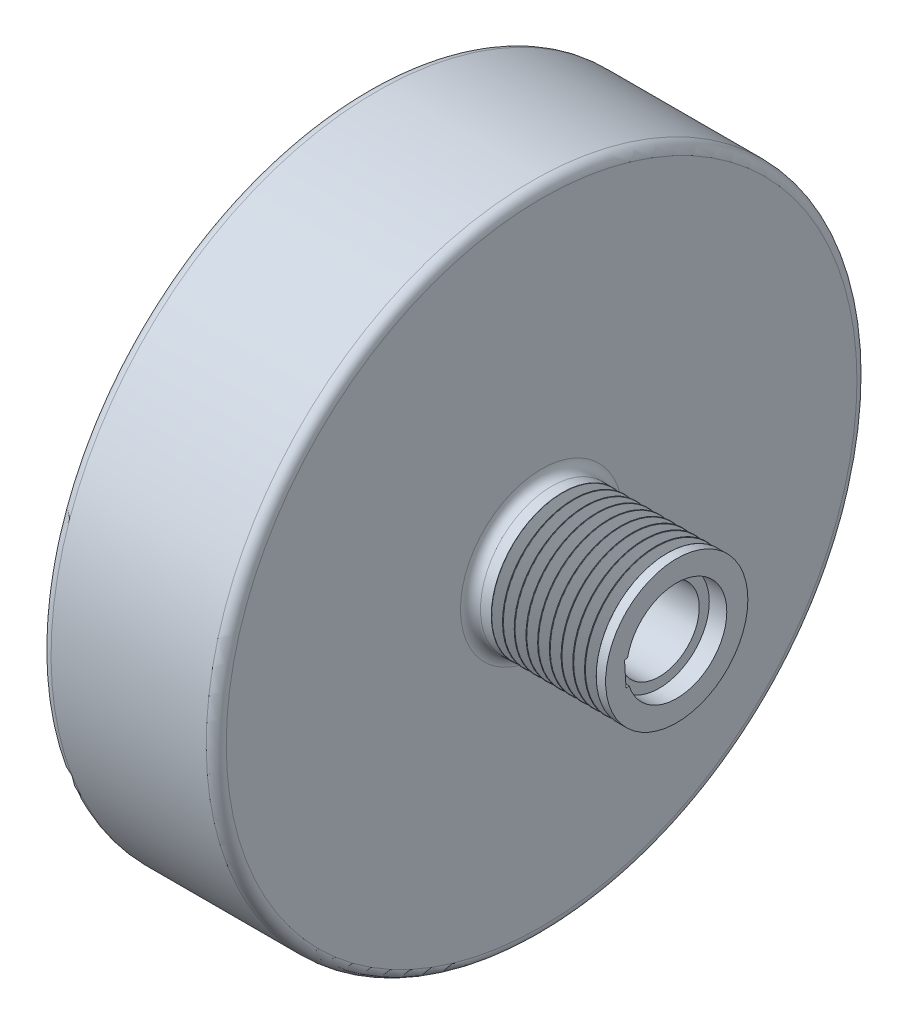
ISO-10303-21;
HEADER;
FILE_DESCRIPTION(('STEP AP214'),'2;1');
FILE_NAME('part.step','',(''),(''),'','','');
FILE_SCHEMA(('AUTOMOTIVE_DESIGN { 1 0 10303 214 1 1 1 1 }'));
ENDSEC;
DATA;
#1=APPLICATION_CONTEXT('core data for automotive mechanical design processes');
#2=APPLICATION_PROTOCOL_DEFINITION('international standard','automotive_design',2000,#1);
#3=PRODUCT_CONTEXT('',#1,'mechanical');
#4=PRODUCT('Part','Part','',(#3));
#5=PRODUCT_RELATED_PRODUCT_CATEGORY('part','',(#4));
#6=PRODUCT_DEFINITION_FORMATION('','',#4);
#7=PRODUCT_DEFINITION_CONTEXT('part definition',#1,'design');
#8=PRODUCT_DEFINITION('design','',#6,#7);
#9=PRODUCT_DEFINITION_SHAPE('','',#8);
#10=(LENGTH_UNIT() NAMED_UNIT(*) SI_UNIT(.MILLI.,.METRE.));
#11=(NAMED_UNIT(*) PLANE_ANGLE_UNIT() SI_UNIT($,.RADIAN.));
#12=(NAMED_UNIT(*) SI_UNIT($,.STERADIAN.) SOLID_ANGLE_UNIT());
#13=UNCERTAINTY_MEASURE_WITH_UNIT(LENGTH_MEASURE(1.E-05),#10,'distance_accuracy_value','');
#14=(GEOMETRIC_REPRESENTATION_CONTEXT(3) GLOBAL_UNCERTAINTY_ASSIGNED_CONTEXT((#13)) GLOBAL_UNIT_ASSIGNED_CONTEXT((#10,
#11,#12)) REPRESENTATION_CONTEXT('',''));
#15=CARTESIAN_POINT('',(0.,0.,0.));
#16=DIRECTION('',(0.,0.,1.));
#17=DIRECTION('',(1.,0.,0.));
#18=AXIS2_PLACEMENT_3D('',#15,#16,#17);
#19=CARTESIAN_POINT('',(31.98,0.,0.));
#20=DIRECTION('',(1.,0.,0.));
#21=DIRECTION('',(0.,-0.479425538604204,0.877582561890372));
#22=AXIS2_PLACEMENT_3D('',#19,#20,#21);
#23=TOROIDAL_SURFACE('',#22,11.7825927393,0.2);
#24=CARTESIAN_POINT('',(31.792061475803,0.,0.));
#25=DIRECTION('',(-1.,0.,0.));
#26=DIRECTION('',(0.,-0.479425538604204,0.877582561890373));
#27=AXIS2_PLACEMENT_3D('',#24,#25,#26);
#28=CIRCLE('',#27,11.7141887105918);
#29=CARTESIAN_POINT('',(31.792061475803,-5.61608123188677,10.2801677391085));
#30=VERTEX_POINT('',#29);
#31=EDGE_CURVE('E398',#30,#30,#28,.T.);
#32=ORIENTED_EDGE('',*,*,#31,.F.);
#33=EDGE_LOOP('',(#32));
#34=FACE_BOUND('',#33,.T.);
#35=CARTESIAN_POINT('',(32.167938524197,0.,0.));
#36=DIRECTION('',(1.,0.,0.));
#37=DIRECTION('',(0.,-0.479425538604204,0.877582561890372));
#38=AXIS2_PLACEMENT_3D('',#35,#36,#37);
#39=CIRCLE('',#38,11.7141887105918);
#40=CARTESIAN_POINT('',(32.167938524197,-5.61608123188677,10.2801677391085));
#41=VERTEX_POINT('',#40);
#42=EDGE_CURVE('E400',#41,#41,#39,.T.);
#43=ORIENTED_EDGE('',*,*,#42,.F.);
#44=EDGE_LOOP('',(#43));
#45=FACE_BOUND('',#44,.T.);
#46=ADVANCED_FACE('F16',(#34,#45),#23,.F.);
#47=CARTESIAN_POINT('',(33.056030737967,0.,0.));
#48=DIRECTION('',(1.,0.,0.));
#49=DIRECTION('',(0.,0.,-1.));
#50=AXIS2_PLACEMENT_3D('',#47,#48,#49);
#51=CONICAL_SURFACE('',#50,14.1542020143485,1.2217304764);
#52=ORIENTED_EDGE('',*,*,#42,.T.);
#53=EDGE_LOOP('',(#52));
#54=FACE_BOUND('',#53,.T.);
#55=CARTESIAN_POINT('',(33.0560307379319,0.,0.));
#56=DIRECTION('',(1.,0.,0.));
#57=DIRECTION('',(0.,-0.479425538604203,0.877582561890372));
#58=AXIS2_PLACEMENT_3D('',#55,#56,#57);
#59=CIRCLE('',#58,14.1542020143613);
#60=CARTESIAN_POINT('',(33.0560307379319,-6.78588592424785,12.421480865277));
#61=VERTEX_POINT('',#60);
#62=EDGE_CURVE('E395',#61,#61,#59,.T.);
#63=ORIENTED_EDGE('',*,*,#62,.F.);
#64=EDGE_LOOP('',(#63));
#65=FACE_BOUND('',#64,.T.);
#66=ADVANCED_FACE('F1202',(#54,#65),#51,.T.);
#67=CARTESIAN_POINT('',(30.9039692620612,0.,0.));
#68=DIRECTION('',(-1.,0.,0.));
#69=DIRECTION('',(0.,-1.,0.));
#70=AXIS2_PLACEMENT_3D('',#67,#68,#69);
#71=CONICAL_SURFACE('',#70,14.154202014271,1.2217304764);
#72=CARTESIAN_POINT('',(30.9039692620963,0.,0.));
#73=DIRECTION('',(1.,0.,0.));
#74=DIRECTION('',(0.,-0.479425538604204,0.877582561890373));
#75=AXIS2_PLACEMENT_3D('',#72,#73,#74);
#76=CIRCLE('',#75,14.1542020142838);
#77=CARTESIAN_POINT('',(30.9039692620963,-6.7858859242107,12.421480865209));
#78=VERTEX_POINT('',#77);
#79=EDGE_CURVE('E392',#78,#78,#76,.F.);
#80=ORIENTED_EDGE('',*,*,#79,.F.);
#81=EDGE_LOOP('',(#80));
#82=FACE_BOUND('',#81,.T.);
#83=ORIENTED_EDGE('',*,*,#31,.T.);
#84=EDGE_LOOP('',(#83));
#85=FACE_BOUND('',#84,.T.);
#86=ADVANCED_FACE('F388',(#82,#85),#71,.T.);
#87=CARTESIAN_POINT('',(33.15,0.,0.));
#88=DIRECTION('',(1.,0.,0.));
#89=DIRECTION('',(0.,-0.479425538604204,0.877582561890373));
#90=AXIS2_PLACEMENT_3D('',#87,#88,#89);
#91=TOROIDAL_SURFACE('',#90,14.12,0.1);
#92=ORIENTED_EDGE('',*,*,#62,.T.);
#93=EDGE_LOOP('',(#92));
#94=FACE_BOUND('',#93,.T.);
#95=CARTESIAN_POINT('',(33.1064110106,0.,0.));
#96=DIRECTION('',(1.,0.,0.));
#97=DIRECTION('',(0.,0.,-1.));
#98=AXIS2_PLACEMENT_3D('',#95,#96,#97);
#99=CIRCLE('',#98,14.21);
#100=CARTESIAN_POINT('',(33.1064110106,0.,-14.21));
#101=VERTEX_POINT('',#100);
#102=EDGE_CURVE('E375',#101,#101,#99,.T.);
#103=ORIENTED_EDGE('',*,*,#102,.F.);
#104=EDGE_LOOP('',(#103));
#105=FACE_BOUND('',#104,.T.);
#106=ADVANCED_FACE('F384',(#94,#105),#91,.T.);
#107=CARTESIAN_POINT('',(30.81,0.,0.));
#108=DIRECTION('',(1.,0.,0.));
#109=DIRECTION('',(0.,-0.479425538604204,0.877582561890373));
#110=AXIS2_PLACEMENT_3D('',#107,#108,#109);
#111=TOROIDAL_SURFACE('',#110,14.12,0.1);
#112=ORIENTED_EDGE('',*,*,#79,.T.);
#113=EDGE_LOOP('',(#112));
#114=FACE_BOUND('',#113,.T.);
#115=CARTESIAN_POINT('',(30.8535889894,0.,0.));
#116=DIRECTION('',(1.,0.,0.));
#117=DIRECTION('',(0.,0.,-1.));
#118=AXIS2_PLACEMENT_3D('',#115,#116,#117);
#119=CIRCLE('',#118,14.21);
#120=CARTESIAN_POINT('',(30.8535889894,0.,-14.21));
#121=VERTEX_POINT('',#120);
#122=EDGE_CURVE('E372',#121,#121,#119,.F.);
#123=ORIENTED_EDGE('',*,*,#122,.F.);
#124=EDGE_LOOP('',(#123));
#125=FACE_BOUND('',#124,.T.);
#126=ADVANCED_FACE('F380',(#114,#125),#111,.T.);
#127=CARTESIAN_POINT('',(11.0000000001,0.,0.));
#128=DIRECTION('',(1.,0.,0.));
#129=DIRECTION('',(0.,0.,-1.));
#130=AXIS2_PLACEMENT_3D('',#127,#128,#129);
#131=CYLINDRICAL_SURFACE('',#130,14.21);
#132=ORIENTED_EDGE('',*,*,#102,.T.);
#133=EDGE_LOOP('',(#132));
#134=FACE_BOUND('',#133,.T.);
#135=CARTESIAN_POINT('',(33.1935889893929,0.,0.));
#136=DIRECTION('',(1.,0.,0.));
#137=DIRECTION('',(0.,-0.479425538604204,0.877582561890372));
#138=AXIS2_PLACEMENT_3D('',#135,#136,#137);
#139=CIRCLE('',#138,14.2100000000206);
#140=CARTESIAN_POINT('',(33.1935889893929,-6.8126369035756,12.4704482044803));
#141=VERTEX_POINT('',#140);
#142=EDGE_CURVE('E369',#141,#141,#139,.T.);
#143=ORIENTED_EDGE('',*,*,#142,.F.);
#144=EDGE_LOOP('',(#143));
#145=FACE_BOUND('',#144,.T.);
#146=ADVANCED_FACE('F383',(#134,#145),#131,.T.);
#147=CARTESIAN_POINT('',(11.0000000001,0.,0.));
#148=DIRECTION('',(1.,0.,0.));
#149=DIRECTION('',(0.,0.,-1.));
#150=AXIS2_PLACEMENT_3D('',#147,#148,#149);
#151=CYLINDRICAL_SURFACE('',#150,14.21);
#152=ORIENTED_EDGE('',*,*,#122,.T.);
#153=EDGE_LOOP('',(#152));
#154=FACE_BOUND('',#153,.T.);
#155=CARTESIAN_POINT('',(30.7664110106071,0.,0.));
#156=DIRECTION('',(1.,0.,0.));
#157=DIRECTION('',(0.,-0.479425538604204,0.877582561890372));
#158=AXIS2_PLACEMENT_3D('',#155,#156,#157);
#159=CIRCLE('',#158,14.2100000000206);
#160=CARTESIAN_POINT('',(30.7664110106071,-6.8126369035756,12.4704482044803));
#161=VERTEX_POINT('',#160);
#162=EDGE_CURVE('E366',#161,#161,#159,.F.);
#163=ORIENTED_EDGE('',*,*,#162,.F.);
#164=EDGE_LOOP('',(#163));
#165=FACE_BOUND('',#164,.T.);
#166=ADVANCED_FACE('F361',(#154,#165),#151,.T.);
#167=CARTESIAN_POINT('',(33.15,0.,0.));
#168=DIRECTION('',(1.,0.,0.));
#169=DIRECTION('',(0.,-0.479425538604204,0.877582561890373));
#170=AXIS2_PLACEMENT_3D('',#167,#168,#169);
#171=TOROIDAL_SURFACE('',#170,14.12,0.1);
#172=CARTESIAN_POINT('',(33.2439692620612,0.,0.));
#173=DIRECTION('',(-1.,0.,0.));
#174=DIRECTION('',(0.,-0.479425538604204,0.877582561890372));
#175=AXIS2_PLACEMENT_3D('',#172,#173,#174);
#176=CIRCLE('',#175,14.154202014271);
#177=CARTESIAN_POINT('',(33.2439692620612,-6.78588592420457,12.4214808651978));
#178=VERTEX_POINT('',#177);
#179=EDGE_CURVE('E348',#178,#178,#176,.F.);
#180=ORIENTED_EDGE('',*,*,#179,.F.);
#181=EDGE_LOOP('',(#180));
#182=FACE_BOUND('',#181,.T.);
#183=ORIENTED_EDGE('',*,*,#142,.T.);
#184=EDGE_LOOP('',(#183));
#185=FACE_BOUND('',#184,.T.);
#186=ADVANCED_FACE('F357',(#182,#185),#171,.T.);
#187=CARTESIAN_POINT('',(30.81,0.,0.));
#188=DIRECTION('',(1.,0.,0.));
#189=DIRECTION('',(0.,-0.479425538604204,0.877582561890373));
#190=AXIS2_PLACEMENT_3D('',#187,#188,#189);
#191=TOROIDAL_SURFACE('',#190,14.12,0.1);
#192=CARTESIAN_POINT('',(30.716030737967,0.,0.));
#193=DIRECTION('',(1.,0.,0.));
#194=DIRECTION('',(0.,-0.479425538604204,0.877582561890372));
#195=AXIS2_PLACEMENT_3D('',#192,#193,#194);
#196=CIRCLE('',#195,14.1542020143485);
#197=CARTESIAN_POINT('',(30.716030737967,-6.78588592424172,12.4214808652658));
#198=VERTEX_POINT('',#197);
#199=EDGE_CURVE('E345',#198,#198,#196,.F.);
#200=ORIENTED_EDGE('',*,*,#199,.F.);
#201=EDGE_LOOP('',(#200));
#202=FACE_BOUND('',#201,.T.);
#203=ORIENTED_EDGE('',*,*,#162,.T.);
#204=EDGE_LOOP('',(#203));
#205=FACE_BOUND('',#204,.T.);
#206=ADVANCED_FACE('F353',(#202,#205),#191,.T.);
#207=CARTESIAN_POINT('',(33.2439692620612,0.,0.));
#208=DIRECTION('',(-1.,0.,0.));
#209=DIRECTION('',(0.,0.,1.));
#210=AXIS2_PLACEMENT_3D('',#207,#208,#209);
#211=CONICAL_SURFACE('',#210,14.154202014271,1.2217304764);
#212=ORIENTED_EDGE('',*,*,#179,.T.);
#213=EDGE_LOOP('',(#212));
#214=FACE_BOUND('',#213,.T.);
#215=CARTESIAN_POINT('',(34.132061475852,0.,0.));
#216=DIRECTION('',(1.,0.,0.));
#217=DIRECTION('',(0.,-0.479425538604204,0.877582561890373));
#218=AXIS2_PLACEMENT_3D('',#215,#216,#217);
#219=CIRCLE('',#218,11.7141887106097);
#220=CARTESIAN_POINT('',(34.132061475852,-5.61608123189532,10.2801677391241));
#221=VERTEX_POINT('',#220);
#222=EDGE_CURVE('E342',#221,#221,#219,.F.);
#223=ORIENTED_EDGE('',*,*,#222,.T.);
#224=EDGE_LOOP('',(#223));
#225=FACE_BOUND('',#224,.T.);
#226=ADVANCED_FACE('F356',(#214,#225),#211,.T.);
#227=CARTESIAN_POINT('',(30.716030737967,0.,0.));
#228=DIRECTION('',(1.,0.,0.));
#229=DIRECTION('',(0.,0.,-1.));
#230=AXIS2_PLACEMENT_3D('',#227,#228,#229);
#231=CONICAL_SURFACE('',#230,14.1542020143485,1.2217304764);
#232=CARTESIAN_POINT('',(29.827938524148,0.,0.));
#233=DIRECTION('',(1.,0.,0.));
#234=DIRECTION('',(0.,-0.479425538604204,0.877582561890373));
#235=AXIS2_PLACEMENT_3D('',#232,#233,#234);
#236=CIRCLE('',#235,11.7141887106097);
#237=CARTESIAN_POINT('',(29.827938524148,-5.61608123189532,10.2801677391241));
#238=VERTEX_POINT('',#237);
#239=EDGE_CURVE('E339',#238,#238,#236,.T.);
#240=ORIENTED_EDGE('',*,*,#239,.T.);
#241=EDGE_LOOP('',(#240));
#242=FACE_BOUND('',#241,.T.);
#243=ORIENTED_EDGE('',*,*,#199,.T.);
#244=EDGE_LOOP('',(#243));
#245=FACE_BOUND('',#244,.T.);
#246=ADVANCED_FACE('F334',(#242,#245),#231,.T.);
#247=CARTESIAN_POINT('',(34.32,0.,0.));
#248=DIRECTION('',(1.,0.,0.));
#249=DIRECTION('',(0.,-0.479425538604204,0.877582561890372));
#250=AXIS2_PLACEMENT_3D('',#247,#248,#249);
#251=TOROIDAL_SURFACE('',#250,11.7825927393,0.2);
#252=ORIENTED_EDGE('',*,*,#222,.F.);
#253=EDGE_LOOP('',(#252));
#254=FACE_BOUND('',#253,.T.);
#255=CARTESIAN_POINT('',(34.507938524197,0.,0.));
#256=DIRECTION('',(1.,0.,0.));
#257=DIRECTION('',(0.,-0.479425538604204,0.877582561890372));
#258=AXIS2_PLACEMENT_3D('',#255,#256,#257);
#259=CIRCLE('',#258,11.7141887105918);
#260=CARTESIAN_POINT('',(34.507938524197,-5.61608123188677,10.2801677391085));
#261=VERTEX_POINT('',#260);
#262=EDGE_CURVE('E321',#261,#261,#259,.T.);
#263=ORIENTED_EDGE('',*,*,#262,.F.);
#264=EDGE_LOOP('',(#263));
#265=FACE_BOUND('',#264,.T.);
#266=ADVANCED_FACE('F330',(#254,#265),#251,.F.);
#267=CARTESIAN_POINT('',(29.64,0.,0.));
#268=DIRECTION('',(1.,0.,0.));
#269=DIRECTION('',(0.,-0.479425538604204,0.877582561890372));
#270=AXIS2_PLACEMENT_3D('',#267,#268,#269);
#271=TOROIDAL_SURFACE('',#270,11.7825927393,0.2);
#272=CARTESIAN_POINT('',(29.452061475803,0.,0.));
#273=DIRECTION('',(-1.,0.,0.));
#274=DIRECTION('',(0.,-0.479425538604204,0.877582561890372));
#275=AXIS2_PLACEMENT_3D('',#272,#273,#274);
#276=CIRCLE('',#275,11.7141887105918);
#277=CARTESIAN_POINT('',(29.452061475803,-5.61608123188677,10.2801677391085));
#278=VERTEX_POINT('',#277);
#279=EDGE_CURVE('E318',#278,#278,#276,.T.);
#280=ORIENTED_EDGE('',*,*,#279,.F.);
#281=EDGE_LOOP('',(#280));
#282=FACE_BOUND('',#281,.T.);
#283=ORIENTED_EDGE('',*,*,#239,.F.);
#284=EDGE_LOOP('',(#283));
#285=FACE_BOUND('',#284,.T.);
#286=ADVANCED_FACE('F326',(#282,#285),#271,.F.);
#287=CARTESIAN_POINT('',(35.396030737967,0.,0.));
#288=DIRECTION('',(1.,0.,0.));
#289=DIRECTION('',(0.,0.,-1.));
#290=AXIS2_PLACEMENT_3D('',#287,#288,#289);
#291=CONICAL_SURFACE('',#290,14.1542020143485,1.2217304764);
#292=ORIENTED_EDGE('',*,*,#262,.T.);
#293=EDGE_LOOP('',(#292));
#294=FACE_BOUND('',#293,.T.);
#295=CARTESIAN_POINT('',(35.3960307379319,0.,0.));
#296=DIRECTION('',(1.,0.,0.));
#297=DIRECTION('',(0.,-0.479425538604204,0.877582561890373));
#298=AXIS2_PLACEMENT_3D('',#295,#296,#297);
#299=CIRCLE('',#298,14.1542020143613);
#300=CARTESIAN_POINT('',(35.3960307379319,-6.78588592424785,12.421480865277));
#301=VERTEX_POINT('',#300);
#302=EDGE_CURVE('E315',#301,#301,#299,.T.);
#303=ORIENTED_EDGE('',*,*,#302,.F.);
#304=EDGE_LOOP('',(#303));
#305=FACE_BOUND('',#304,.T.);
#306=ADVANCED_FACE('F329',(#294,#305),#291,.T.);
#307=CARTESIAN_POINT('',(28.5639692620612,0.,0.));
#308=DIRECTION('',(-1.,0.,0.));
#309=DIRECTION('',(0.,0.,1.));
#310=AXIS2_PLACEMENT_3D('',#307,#308,#309);
#311=CONICAL_SURFACE('',#310,14.154202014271,1.2217304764);
#312=CARTESIAN_POINT('',(28.5639692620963,0.,0.));
#313=DIRECTION('',(1.,0.,0.));
#314=DIRECTION('',(0.,-0.479425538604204,0.877582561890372));
#315=AXIS2_PLACEMENT_3D('',#312,#313,#314);
#316=CIRCLE('',#315,14.1542020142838);
#317=CARTESIAN_POINT('',(28.5639692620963,-6.7858859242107,12.421480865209));
#318=VERTEX_POINT('',#317);
#319=EDGE_CURVE('E312',#318,#318,#316,.F.);
#320=ORIENTED_EDGE('',*,*,#319,.F.);
#321=EDGE_LOOP('',(#320));
#322=FACE_BOUND('',#321,.T.);
#323=ORIENTED_EDGE('',*,*,#279,.T.);
#324=EDGE_LOOP('',(#323));
#325=FACE_BOUND('',#324,.T.);
#326=ADVANCED_FACE('F306',(#322,#325),#311,.T.);
#327=CARTESIAN_POINT('',(35.49,0.,0.));
#328=DIRECTION('',(1.,0.,0.));
#329=DIRECTION('',(0.,-0.479425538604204,0.877582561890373));
#330=AXIS2_PLACEMENT_3D('',#327,#328,#329);
#331=TOROIDAL_SURFACE('',#330,14.12,0.1);
#332=ORIENTED_EDGE('',*,*,#302,.T.);
#333=EDGE_LOOP('',(#332));
#334=FACE_BOUND('',#333,.T.);
#335=CARTESIAN_POINT('',(35.4464110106,0.,0.));
#336=DIRECTION('',(1.,0.,0.));
#337=DIRECTION('',(0.,0.,-1.));
#338=AXIS2_PLACEMENT_3D('',#335,#336,#337);
#339=CIRCLE('',#338,14.21);
#340=CARTESIAN_POINT('',(35.4464110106,0.,-14.21));
#341=VERTEX_POINT('',#340);
#342=EDGE_CURVE('E311',#341,#341,#339,.T.);
#343=ORIENTED_EDGE('',*,*,#342,.F.);
#344=EDGE_LOOP('',(#343));
#345=FACE_BOUND('',#344,.T.);
#346=ADVANCED_FACE('F301',(#334,#345),#331,.T.);
#347=CARTESIAN_POINT('',(28.47,0.,0.));
#348=DIRECTION('',(1.,0.,0.));
#349=DIRECTION('',(0.,-0.479425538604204,0.877582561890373));
#350=AXIS2_PLACEMENT_3D('',#347,#348,#349);
#351=TOROIDAL_SURFACE('',#350,14.12,0.1);
#352=ORIENTED_EDGE('',*,*,#319,.T.);
#353=EDGE_LOOP('',(#352));
#354=FACE_BOUND('',#353,.T.);
#355=CARTESIAN_POINT('',(28.5135889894,0.,0.));
#356=DIRECTION('',(1.,0.,0.));
#357=DIRECTION('',(0.,0.,-1.));
#358=AXIS2_PLACEMENT_3D('',#355,#356,#357);
#359=CIRCLE('',#358,14.21);
#360=CARTESIAN_POINT('',(28.5135889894,0.,-14.21));
#361=VERTEX_POINT('',#360);
#362=EDGE_CURVE('E292',#361,#361,#359,.F.);
#363=ORIENTED_EDGE('',*,*,#362,.F.);
#364=EDGE_LOOP('',(#363));
#365=FACE_BOUND('',#364,.T.);
#366=ADVANCED_FACE('F297',(#354,#365),#351,.T.);
#367=CARTESIAN_POINT('',(11.0000000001,0.,0.));
#368=DIRECTION('',(1.,0.,0.));
#369=DIRECTION('',(0.,0.,-1.));
#370=AXIS2_PLACEMENT_3D('',#367,#368,#369);
#371=CYLINDRICAL_SURFACE('',#370,14.21);
#372=ORIENTED_EDGE('',*,*,#342,.T.);
#373=EDGE_LOOP('',(#372));
#374=FACE_BOUND('',#373,.T.);
#375=CARTESIAN_POINT('',(35.5335889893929,0.,0.));
#376=DIRECTION('',(1.,0.,0.));
#377=DIRECTION('',(0.,-0.479425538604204,0.877582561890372));
#378=AXIS2_PLACEMENT_3D('',#375,#376,#377);
#379=CIRCLE('',#378,14.2100000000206);
#380=CARTESIAN_POINT('',(35.5335889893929,-6.8126369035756,12.4704482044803));
#381=VERTEX_POINT('',#380);
#382=EDGE_CURVE('E289',#381,#381,#379,.T.);
#383=ORIENTED_EDGE('',*,*,#382,.F.);
#384=EDGE_LOOP('',(#383));
#385=FACE_BOUND('',#384,.T.);
#386=ADVANCED_FACE('F300',(#374,#385),#371,.T.);
#387=CARTESIAN_POINT('',(11.0000000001,0.,0.));
#388=DIRECTION('',(1.,0.,0.));
#389=DIRECTION('',(0.,0.,-1.));
#390=AXIS2_PLACEMENT_3D('',#387,#388,#389);
#391=CYLINDRICAL_SURFACE('',#390,14.21);
#392=CARTESIAN_POINT('',(28.4264110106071,0.,0.));
#393=DIRECTION('',(1.,0.,0.));
#394=DIRECTION('',(0.,-0.479425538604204,0.877582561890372));
#395=AXIS2_PLACEMENT_3D('',#392,#393,#394);
#396=CIRCLE('',#395,14.2100000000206);
#397=CARTESIAN_POINT('',(28.4264110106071,-6.8126369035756,12.4704482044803));
#398=VERTEX_POINT('',#397);
#399=EDGE_CURVE('E286',#398,#398,#396,.F.);
#400=ORIENTED_EDGE('',*,*,#399,.F.);
#401=EDGE_LOOP('',(#400));
#402=FACE_BOUND('',#401,.T.);
#403=ORIENTED_EDGE('',*,*,#362,.T.);
#404=EDGE_LOOP('',(#403));
#405=FACE_BOUND('',#404,.T.);
#406=ADVANCED_FACE('F281',(#402,#405),#391,.T.);
#407=CARTESIAN_POINT('',(35.49,0.,0.));
#408=DIRECTION('',(1.,0.,0.));
#409=DIRECTION('',(0.,-0.479425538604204,0.877582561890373));
#410=AXIS2_PLACEMENT_3D('',#407,#408,#409);
#411=TOROIDAL_SURFACE('',#410,14.12,0.1);
#412=CARTESIAN_POINT('',(35.5839692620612,0.,0.));
#413=DIRECTION('',(-1.,0.,0.));
#414=DIRECTION('',(0.,-0.479425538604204,0.877582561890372));
#415=AXIS2_PLACEMENT_3D('',#412,#413,#414);
#416=CIRCLE('',#415,14.154202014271);
#417=CARTESIAN_POINT('',(35.5839692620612,-6.78588592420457,12.4214808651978));
#418=VERTEX_POINT('',#417);
#419=EDGE_CURVE('E267',#418,#418,#416,.F.);
#420=ORIENTED_EDGE('',*,*,#419,.F.);
#421=EDGE_LOOP('',(#420));
#422=FACE_BOUND('',#421,.T.);
#423=ORIENTED_EDGE('',*,*,#382,.T.);
#424=EDGE_LOOP('',(#423));
#425=FACE_BOUND('',#424,.T.);
#426=ADVANCED_FACE('F277',(#422,#425),#411,.T.);
#427=CARTESIAN_POINT('',(28.47,0.,0.));
#428=DIRECTION('',(1.,0.,0.));
#429=DIRECTION('',(0.,-0.479425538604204,0.877582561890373));
#430=AXIS2_PLACEMENT_3D('',#427,#428,#429);
#431=TOROIDAL_SURFACE('',#430,14.12,0.1);
#432=CARTESIAN_POINT('',(28.376030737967,0.,0.));
#433=DIRECTION('',(1.,0.,0.));
#434=DIRECTION('',(0.,-0.479425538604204,0.877582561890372));
#435=AXIS2_PLACEMENT_3D('',#432,#433,#434);
#436=CIRCLE('',#435,14.1542020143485);
#437=CARTESIAN_POINT('',(28.376030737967,-6.78588592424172,12.4214808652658));
#438=VERTEX_POINT('',#437);
#439=EDGE_CURVE('E264',#438,#438,#436,.F.);
#440=ORIENTED_EDGE('',*,*,#439,.F.);
#441=EDGE_LOOP('',(#440));
#442=FACE_BOUND('',#441,.T.);
#443=ORIENTED_EDGE('',*,*,#399,.T.);
#444=EDGE_LOOP('',(#443));
#445=FACE_BOUND('',#444,.T.);
#446=ADVANCED_FACE('F272',(#442,#445),#431,.T.);
#447=CARTESIAN_POINT('',(35.5839692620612,0.,0.));
#448=DIRECTION('',(-1.,0.,0.));
#449=DIRECTION('',(0.,0.,1.));
#450=AXIS2_PLACEMENT_3D('',#447,#448,#449);
#451=CONICAL_SURFACE('',#450,14.154202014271,1.2217304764);
#452=ORIENTED_EDGE('',*,*,#419,.T.);
#453=EDGE_LOOP('',(#452));
#454=FACE_BOUND('',#453,.T.);
#455=CARTESIAN_POINT('',(36.472061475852,0.,0.));
#456=DIRECTION('',(1.,0.,0.));
#457=DIRECTION('',(0.,-0.479425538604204,0.877582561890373));
#458=AXIS2_PLACEMENT_3D('',#455,#456,#457);
#459=CIRCLE('',#458,11.7141887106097);
#460=CARTESIAN_POINT('',(36.472061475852,-5.61608123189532,10.2801677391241));
#461=VERTEX_POINT('',#460);
#462=EDGE_CURVE('E261',#461,#461,#459,.F.);
#463=ORIENTED_EDGE('',*,*,#462,.T.);
#464=EDGE_LOOP('',(#463));
#465=FACE_BOUND('',#464,.T.);
#466=ADVANCED_FACE('F276',(#454,#465),#451,.T.);
#467=CARTESIAN_POINT('',(28.376030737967,0.,0.));
#468=DIRECTION('',(1.,0.,0.));
#469=DIRECTION('',(0.,0.,-1.));
#470=AXIS2_PLACEMENT_3D('',#467,#468,#469);
#471=CONICAL_SURFACE('',#470,14.1542020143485,1.2217304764);
#472=CARTESIAN_POINT('',(27.487938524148,0.,0.));
#473=DIRECTION('',(1.,0.,0.));
#474=DIRECTION('',(0.,-0.479425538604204,0.877582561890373));
#475=AXIS2_PLACEMENT_3D('',#472,#473,#474);
#476=CIRCLE('',#475,11.7141887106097);
#477=CARTESIAN_POINT('',(27.487938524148,-5.61608123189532,10.2801677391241));
#478=VERTEX_POINT('',#477);
#479=EDGE_CURVE('E256',#478,#478,#476,.T.);
#480=ORIENTED_EDGE('',*,*,#479,.T.);
#481=EDGE_LOOP('',(#480));
#482=FACE_BOUND('',#481,.T.);
#483=ORIENTED_EDGE('',*,*,#439,.T.);
#484=EDGE_LOOP('',(#483));
#485=FACE_BOUND('',#484,.T.);
#486=ADVANCED_FACE('F1074',(#482,#485),#471,.T.);
#487=CARTESIAN_POINT('',(36.66,0.,0.));
#488=DIRECTION('',(1.,0.,0.));
#489=DIRECTION('',(0.,-0.479425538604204,0.877582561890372));
#490=AXIS2_PLACEMENT_3D('',#487,#488,#489);
#491=TOROIDAL_SURFACE('',#490,11.7825927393,0.2);
#492=ORIENTED_EDGE('',*,*,#462,.F.);
#493=EDGE_LOOP('',(#492));
#494=FACE_BOUND('',#493,.T.);
#495=CARTESIAN_POINT('',(36.847938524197,0.,0.));
#496=DIRECTION('',(1.,0.,0.));
#497=DIRECTION('',(0.,-0.479425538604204,0.877582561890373));
#498=AXIS2_PLACEMENT_3D('',#495,#496,#497);
#499=CIRCLE('',#498,11.7141887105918);
#500=CARTESIAN_POINT('',(36.847938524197,-5.61608123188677,10.2801677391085));
#501=VERTEX_POINT('',#500);
#502=EDGE_CURVE('E254',#501,#501,#499,.T.);
#503=ORIENTED_EDGE('',*,*,#502,.F.);
#504=EDGE_LOOP('',(#503));
#505=FACE_BOUND('',#504,.T.);
#506=ADVANCED_FACE('F245',(#494,#505),#491,.F.);
#507=CARTESIAN_POINT('',(27.3,0.,0.));
#508=DIRECTION('',(1.,0.,0.));
#509=DIRECTION('',(0.,-0.479425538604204,0.877582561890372));
#510=AXIS2_PLACEMENT_3D('',#507,#508,#509);
#511=TOROIDAL_SURFACE('',#510,11.7825927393,0.2);
#512=CARTESIAN_POINT('',(27.112061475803,0.,0.));
#513=DIRECTION('',(-1.,0.,0.));
#514=DIRECTION('',(0.,-0.479425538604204,0.877582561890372));
#515=AXIS2_PLACEMENT_3D('',#512,#513,#514);
#516=CIRCLE('',#515,11.7141887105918);
#517=CARTESIAN_POINT('',(27.112061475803,-5.61608123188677,10.2801677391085));
#518=VERTEX_POINT('',#517);
#519=EDGE_CURVE('E252',#518,#518,#516,.T.);
#520=ORIENTED_EDGE('',*,*,#519,.F.);
#521=EDGE_LOOP('',(#520));
#522=FACE_BOUND('',#521,.T.);
#523=ORIENTED_EDGE('',*,*,#479,.F.);
#524=EDGE_LOOP('',(#523));
#525=FACE_BOUND('',#524,.T.);
#526=ADVANCED_FACE('F240',(#522,#525),#511,.F.);
#527=CARTESIAN_POINT('',(37.736030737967,0.,0.));
#528=DIRECTION('',(1.,0.,0.));
#529=DIRECTION('',(0.,0.,-1.));
#530=AXIS2_PLACEMENT_3D('',#527,#528,#529);
#531=CONICAL_SURFACE('',#530,14.1542020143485,1.2217304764);
#532=ORIENTED_EDGE('',*,*,#502,.T.);
#533=EDGE_LOOP('',(#532));
#534=FACE_BOUND('',#533,.T.);
#535=CARTESIAN_POINT('',(37.7360307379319,0.,0.));
#536=DIRECTION('',(1.,0.,0.));
#537=DIRECTION('',(0.,-0.479425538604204,0.877582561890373));
#538=AXIS2_PLACEMENT_3D('',#535,#536,#537);
#539=CIRCLE('',#538,14.1542020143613);
#540=CARTESIAN_POINT('',(37.7360307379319,-6.78588592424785,12.421480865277));
#541=VERTEX_POINT('',#540);
#542=EDGE_CURVE('E1323',#541,#541,#539,.T.);
#543=ORIENTED_EDGE('',*,*,#542,.F.);
#544=EDGE_LOOP('',(#543));
#545=FACE_BOUND('',#544,.T.);
#546=ADVANCED_FACE('F236',(#534,#545),#531,.T.);
#547=CARTESIAN_POINT('',(26.2239692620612,0.,0.));
#548=DIRECTION('',(-1.,0.,0.));
#549=DIRECTION('',(0.,0.,1.));
#550=AXIS2_PLACEMENT_3D('',#547,#548,#549);
#551=CONICAL_SURFACE('',#550,14.154202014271,1.2217304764);
#552=CARTESIAN_POINT('',(26.2239692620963,0.,0.));
#553=DIRECTION('',(1.,0.,0.));
#554=DIRECTION('',(0.,-0.479425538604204,0.877582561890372));
#555=AXIS2_PLACEMENT_3D('',#552,#553,#554);
#556=CIRCLE('',#555,14.1542020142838);
#557=CARTESIAN_POINT('',(26.2239692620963,-6.7858859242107,12.421480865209));
#558=VERTEX_POINT('',#557);
#559=EDGE_CURVE('E1324',#558,#558,#556,.F.);
#560=ORIENTED_EDGE('',*,*,#559,.F.);
#561=EDGE_LOOP('',(#560));
#562=FACE_BOUND('',#561,.T.);
#563=ORIENTED_EDGE('',*,*,#519,.T.);
#564=EDGE_LOOP('',(#563));
#565=FACE_BOUND('',#564,.T.);
#566=ADVANCED_FACE('F232',(#562,#565),#551,.T.);
#567=CARTESIAN_POINT('',(37.83,0.,0.));
#568=DIRECTION('',(1.,0.,0.));
#569=DIRECTION('',(0.,-0.479425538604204,0.877582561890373));
#570=AXIS2_PLACEMENT_3D('',#567,#568,#569);
#571=TOROIDAL_SURFACE('',#570,14.12,0.1);
#572=ORIENTED_EDGE('',*,*,#542,.T.);
#573=EDGE_LOOP('',(#572));
#574=FACE_BOUND('',#573,.T.);
#575=CARTESIAN_POINT('',(37.7864110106,0.,0.));
#576=DIRECTION('',(1.,0.,0.));
#577=DIRECTION('',(0.,0.,-1.));
#578=AXIS2_PLACEMENT_3D('',#575,#576,#577);
#579=CIRCLE('',#578,14.21);
#580=CARTESIAN_POINT('',(37.7864110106,0.,-14.21));
#581=VERTEX_POINT('',#580);
#582=EDGE_CURVE('E218',#581,#581,#579,.T.);
#583=ORIENTED_EDGE('',*,*,#582,.F.);
#584=EDGE_LOOP('',(#583));
#585=FACE_BOUND('',#584,.T.);
#586=ADVANCED_FACE('F228',(#574,#585),#571,.T.);
#587=CARTESIAN_POINT('',(26.13,0.,0.));
#588=DIRECTION('',(1.,0.,0.));
#589=DIRECTION('',(0.,-0.479425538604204,0.877582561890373));
#590=AXIS2_PLACEMENT_3D('',#587,#588,#589);
#591=TOROIDAL_SURFACE('',#590,14.12,0.1);
#592=ORIENTED_EDGE('',*,*,#559,.T.);
#593=EDGE_LOOP('',(#592));
#594=FACE_BOUND('',#593,.T.);
#595=CARTESIAN_POINT('',(26.1735889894,0.,0.));
#596=DIRECTION('',(1.,0.,0.));
#597=DIRECTION('',(0.,0.,-1.));
#598=AXIS2_PLACEMENT_3D('',#595,#596,#597);
#599=CIRCLE('',#598,14.21);
#600=CARTESIAN_POINT('',(26.1735889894,0.,-14.21));
#601=VERTEX_POINT('',#600);
#602=EDGE_CURVE('E215',#601,#601,#599,.F.);
#603=ORIENTED_EDGE('',*,*,#602,.F.);
#604=EDGE_LOOP('',(#603));
#605=FACE_BOUND('',#604,.T.);
#606=ADVANCED_FACE('F224',(#594,#605),#591,.T.);
#607=CARTESIAN_POINT('',(11.0000000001,0.,0.));
#608=DIRECTION('',(1.,0.,0.));
#609=DIRECTION('',(0.,0.,-1.));
#610=AXIS2_PLACEMENT_3D('',#607,#608,#609);
#611=CYLINDRICAL_SURFACE('',#610,14.21);
#612=CARTESIAN_POINT('',(37.8735889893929,0.,0.));
#613=DIRECTION('',(1.,0.,0.));
#614=DIRECTION('',(0.,-0.479425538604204,0.877582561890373));
#615=AXIS2_PLACEMENT_3D('',#612,#613,#614);
#616=CIRCLE('',#615,14.2100000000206);
#617=CARTESIAN_POINT('',(37.8735889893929,-6.8126369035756,12.4704482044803));
#618=VERTEX_POINT('',#617);
#619=EDGE_CURVE('E212',#618,#618,#616,.T.);
#620=ORIENTED_EDGE('',*,*,#619,.F.);
#621=EDGE_LOOP('',(#620));
#622=FACE_BOUND('',#621,.T.);
#623=ORIENTED_EDGE('',*,*,#582,.T.);
#624=EDGE_LOOP('',(#623));
#625=FACE_BOUND('',#624,.T.);
#626=ADVANCED_FACE('F227',(#622,#625),#611,.T.);
#627=CARTESIAN_POINT('',(11.0000000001,0.,0.));
#628=DIRECTION('',(1.,0.,0.));
#629=DIRECTION('',(0.,0.,-1.));
#630=AXIS2_PLACEMENT_3D('',#627,#628,#629);
#631=CYLINDRICAL_SURFACE('',#630,14.21);
#632=CARTESIAN_POINT('',(26.0864110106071,0.,0.));
#633=DIRECTION('',(1.,0.,0.));
#634=DIRECTION('',(0.,-0.479425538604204,0.877582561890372));
#635=AXIS2_PLACEMENT_3D('',#632,#633,#634);
#636=CIRCLE('',#635,14.2100000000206);
#637=CARTESIAN_POINT('',(26.0864110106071,-6.8126369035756,12.4704482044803));
#638=VERTEX_POINT('',#637);
#639=EDGE_CURVE('E209',#638,#638,#636,.F.);
#640=ORIENTED_EDGE('',*,*,#639,.F.);
#641=EDGE_LOOP('',(#640));
#642=FACE_BOUND('',#641,.T.);
#643=ORIENTED_EDGE('',*,*,#602,.T.);
#644=EDGE_LOOP('',(#643));
#645=FACE_BOUND('',#644,.T.);
#646=ADVANCED_FACE('F204',(#642,#645),#631,.T.);
#647=CARTESIAN_POINT('',(37.83,0.,0.));
#648=DIRECTION('',(1.,0.,0.));
#649=DIRECTION('',(0.,-0.479425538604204,0.877582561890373));
#650=AXIS2_PLACEMENT_3D('',#647,#648,#649);
#651=TOROIDAL_SURFACE('',#650,14.12,0.1);
#652=CARTESIAN_POINT('',(37.9239692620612,0.,0.));
#653=DIRECTION('',(-1.,0.,0.));
#654=DIRECTION('',(0.,-0.479425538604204,0.877582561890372));
#655=AXIS2_PLACEMENT_3D('',#652,#653,#654);
#656=CIRCLE('',#655,14.154202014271);
#657=CARTESIAN_POINT('',(37.9239692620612,-6.78588592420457,12.4214808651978));
#658=VERTEX_POINT('',#657);
#659=EDGE_CURVE('E190',#658,#658,#656,.F.);
#660=ORIENTED_EDGE('',*,*,#659,.F.);
#661=EDGE_LOOP('',(#660));
#662=FACE_BOUND('',#661,.T.);
#663=ORIENTED_EDGE('',*,*,#619,.T.);
#664=EDGE_LOOP('',(#663));
#665=FACE_BOUND('',#664,.T.);
#666=ADVANCED_FACE('F200',(#662,#665),#651,.T.);
#667=CARTESIAN_POINT('',(26.13,0.,0.));
#668=DIRECTION('',(1.,0.,0.));
#669=DIRECTION('',(0.,-0.479425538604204,0.877582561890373));
#670=AXIS2_PLACEMENT_3D('',#667,#668,#669);
#671=TOROIDAL_SURFACE('',#670,14.12,0.1);
#672=CARTESIAN_POINT('',(26.036030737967,0.,0.));
#673=DIRECTION('',(1.,0.,0.));
#674=DIRECTION('',(0.,-0.479425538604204,0.877582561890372));
#675=AXIS2_PLACEMENT_3D('',#672,#673,#674);
#676=CIRCLE('',#675,14.1542020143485);
#677=CARTESIAN_POINT('',(26.036030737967,-6.78588592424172,12.4214808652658));
#678=VERTEX_POINT('',#677);
#679=EDGE_CURVE('E187',#678,#678,#676,.F.);
#680=ORIENTED_EDGE('',*,*,#679,.F.);
#681=EDGE_LOOP('',(#680));
#682=FACE_BOUND('',#681,.T.);
#683=ORIENTED_EDGE('',*,*,#639,.T.);
#684=EDGE_LOOP('',(#683));
#685=FACE_BOUND('',#684,.T.);
#686=ADVANCED_FACE('F195',(#682,#685),#671,.T.);
#687=CARTESIAN_POINT('',(37.9239692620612,0.,0.));
#688=DIRECTION('',(-1.,0.,0.));
#689=DIRECTION('',(0.,-1.,0.));
#690=AXIS2_PLACEMENT_3D('',#687,#688,#689);
#691=CONICAL_SURFACE('',#690,14.154202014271,1.2217304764);
#692=ORIENTED_EDGE('',*,*,#659,.T.);
#693=EDGE_LOOP('',(#692));
#694=FACE_BOUND('',#693,.T.);
#695=CARTESIAN_POINT('',(38.812061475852,0.,0.));
#696=DIRECTION('',(1.,0.,0.));
#697=DIRECTION('',(0.,-0.479425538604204,0.877582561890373));
#698=AXIS2_PLACEMENT_3D('',#695,#696,#697);
#699=CIRCLE('',#698,11.7141887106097);
#700=CARTESIAN_POINT('',(38.812061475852,-5.61608123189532,10.2801677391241));
#701=VERTEX_POINT('',#700);
#702=EDGE_CURVE('E184',#701,#701,#699,.F.);
#703=ORIENTED_EDGE('',*,*,#702,.T.);
#704=EDGE_LOOP('',(#703));
#705=FACE_BOUND('',#704,.T.);
#706=ADVANCED_FACE('F199',(#694,#705),#691,.T.);
#707=CARTESIAN_POINT('',(26.036030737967,0.,0.));
#708=DIRECTION('',(1.,0.,0.));
#709=DIRECTION('',(0.,0.,-1.));
#710=AXIS2_PLACEMENT_3D('',#707,#708,#709);
#711=CONICAL_SURFACE('',#710,14.1542020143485,1.2217304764);
#712=CARTESIAN_POINT('',(25.147938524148,0.,0.));
#713=DIRECTION('',(1.,0.,0.));
#714=DIRECTION('',(0.,-0.479425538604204,0.877582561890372));
#715=AXIS2_PLACEMENT_3D('',#712,#713,#714);
#716=CIRCLE('',#715,11.7141887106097);
#717=CARTESIAN_POINT('',(25.147938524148,-5.61608123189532,10.2801677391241));
#718=VERTEX_POINT('',#717);
#719=EDGE_CURVE('E179',#718,#718,#716,.T.);
#720=ORIENTED_EDGE('',*,*,#719,.T.);
#721=EDGE_LOOP('',(#720));
#722=FACE_BOUND('',#721,.T.);
#723=ORIENTED_EDGE('',*,*,#679,.T.);
#724=EDGE_LOOP('',(#723));
#725=FACE_BOUND('',#724,.T.);
#726=ADVANCED_FACE('F1003',(#722,#725),#711,.T.);
#727=CARTESIAN_POINT('',(39.,0.,0.));
#728=DIRECTION('',(1.,0.,0.));
#729=DIRECTION('',(0.,-0.479425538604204,0.877582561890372));
#730=AXIS2_PLACEMENT_3D('',#727,#728,#729);
#731=TOROIDAL_SURFACE('',#730,11.7825927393,0.2);
#732=ORIENTED_EDGE('',*,*,#702,.F.);
#733=EDGE_LOOP('',(#732));
#734=FACE_BOUND('',#733,.T.);
#735=CARTESIAN_POINT('',(39.187938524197,0.,0.));
#736=DIRECTION('',(1.,0.,0.));
#737=DIRECTION('',(0.,-0.479425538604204,0.877582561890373));
#738=AXIS2_PLACEMENT_3D('',#735,#736,#737);
#739=CIRCLE('',#738,11.7141887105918);
#740=CARTESIAN_POINT('',(39.187938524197,-5.61608123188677,10.2801677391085));
#741=VERTEX_POINT('',#740);
#742=EDGE_CURVE('E177',#741,#741,#739,.T.);
#743=ORIENTED_EDGE('',*,*,#742,.F.);
#744=EDGE_LOOP('',(#743));
#745=FACE_BOUND('',#744,.T.);
#746=ADVANCED_FACE('F168',(#734,#745),#731,.F.);
#747=CARTESIAN_POINT('',(24.96,0.,0.));
#748=DIRECTION('',(1.,0.,0.));
#749=DIRECTION('',(0.,-0.479425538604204,0.877582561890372));
#750=AXIS2_PLACEMENT_3D('',#747,#748,#749);
#751=TOROIDAL_SURFACE('',#750,11.7825927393,0.2);
#752=CARTESIAN_POINT('',(24.772061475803,0.,0.));
#753=DIRECTION('',(-1.,0.,0.));
#754=DIRECTION('',(0.,-0.479425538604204,0.877582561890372));
#755=AXIS2_PLACEMENT_3D('',#752,#753,#754);
#756=CIRCLE('',#755,11.7141887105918);
#757=CARTESIAN_POINT('',(24.772061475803,-5.61608123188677,10.2801677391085));
#758=VERTEX_POINT('',#757);
#759=EDGE_CURVE('E175',#758,#758,#756,.T.);
#760=ORIENTED_EDGE('',*,*,#759,.F.);
#761=EDGE_LOOP('',(#760));
#762=FACE_BOUND('',#761,.T.);
#763=ORIENTED_EDGE('',*,*,#719,.F.);
#764=EDGE_LOOP('',(#763));
#765=FACE_BOUND('',#764,.T.);
#766=ADVANCED_FACE('F163',(#762,#765),#751,.F.);
#767=CARTESIAN_POINT('',(40.076030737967,0.,0.));
#768=DIRECTION('',(1.,0.,0.));
#769=DIRECTION('',(0.,1.,0.));
#770=AXIS2_PLACEMENT_3D('',#767,#768,#769);
#771=CONICAL_SURFACE('',#770,14.1542020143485,1.2217304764);
#772=ORIENTED_EDGE('',*,*,#742,.T.);
#773=EDGE_LOOP('',(#772));
#774=FACE_BOUND('',#773,.T.);
#775=CARTESIAN_POINT('',(40.0760307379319,0.,0.));
#776=DIRECTION('',(1.,0.,0.));
#777=DIRECTION('',(0.,-0.479425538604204,0.877582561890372));
#778=AXIS2_PLACEMENT_3D('',#775,#776,#777);
#779=CIRCLE('',#778,14.1542020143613);
#780=CARTESIAN_POINT('',(40.0760307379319,-6.78588592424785,12.421480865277));
#781=VERTEX_POINT('',#780);
#782=EDGE_CURVE('E1355',#781,#781,#779,.T.);
#783=ORIENTED_EDGE('',*,*,#782,.F.);
#784=EDGE_LOOP('',(#783));
#785=FACE_BOUND('',#784,.T.);
#786=ADVANCED_FACE('F159',(#774,#785),#771,.T.);
#787=CARTESIAN_POINT('',(23.8839692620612,0.,0.));
#788=DIRECTION('',(-1.,0.,0.));
#789=DIRECTION('',(0.,0.,1.));
#790=AXIS2_PLACEMENT_3D('',#787,#788,#789);
#791=CONICAL_SURFACE('',#790,14.154202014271,1.2217304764);
#792=CARTESIAN_POINT('',(23.8839692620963,0.,0.));
#793=DIRECTION('',(1.,0.,0.));
#794=DIRECTION('',(0.,-0.479425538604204,0.877582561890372));
#795=AXIS2_PLACEMENT_3D('',#792,#793,#794);
#796=CIRCLE('',#795,14.1542020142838);
#797=CARTESIAN_POINT('',(23.8839692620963,-6.7858859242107,12.421480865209));
#798=VERTEX_POINT('',#797);
#799=EDGE_CURVE('E1356',#798,#798,#796,.F.);
#800=ORIENTED_EDGE('',*,*,#799,.F.);
#801=EDGE_LOOP('',(#800));
#802=FACE_BOUND('',#801,.T.);
#803=ORIENTED_EDGE('',*,*,#759,.T.);
#804=EDGE_LOOP('',(#803));
#805=FACE_BOUND('',#804,.T.);
#806=ADVANCED_FACE('F155',(#802,#805),#791,.T.);
#807=CARTESIAN_POINT('',(40.17,0.,0.));
#808=DIRECTION('',(1.,0.,0.));
#809=DIRECTION('',(0.,-0.479425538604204,0.877582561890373));
#810=AXIS2_PLACEMENT_3D('',#807,#808,#809);
#811=TOROIDAL_SURFACE('',#810,14.12,0.1);
#812=ORIENTED_EDGE('',*,*,#782,.T.);
#813=EDGE_LOOP('',(#812));
#814=FACE_BOUND('',#813,.T.);
#815=CARTESIAN_POINT('',(40.1264110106,0.,0.));
#816=DIRECTION('',(1.,0.,0.));
#817=DIRECTION('',(0.,0.,-1.));
#818=AXIS2_PLACEMENT_3D('',#815,#816,#817);
#819=CIRCLE('',#818,14.21);
#820=CARTESIAN_POINT('',(40.1264110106,0.,-14.21));
#821=VERTEX_POINT('',#820);
#822=EDGE_CURVE('E139',#821,#821,#819,.T.);
#823=ORIENTED_EDGE('',*,*,#822,.F.);
#824=EDGE_LOOP('',(#823));
#825=FACE_BOUND('',#824,.T.);
#826=ADVANCED_FACE('F150',(#814,#825),#811,.T.);
#827=CARTESIAN_POINT('',(23.79,0.,0.));
#828=DIRECTION('',(1.,0.,0.));
#829=DIRECTION('',(0.,-0.479425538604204,0.877582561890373));
#830=AXIS2_PLACEMENT_3D('',#827,#828,#829);
#831=TOROIDAL_SURFACE('',#830,14.12,0.1);
#832=ORIENTED_EDGE('',*,*,#799,.T.);
#833=EDGE_LOOP('',(#832));
#834=FACE_BOUND('',#833,.T.);
#835=CARTESIAN_POINT('',(23.8335889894,0.,0.));
#836=DIRECTION('',(1.,0.,0.));
#837=DIRECTION('',(0.,0.,-1.));
#838=AXIS2_PLACEMENT_3D('',#835,#836,#837);
#839=CIRCLE('',#838,14.21);
#840=CARTESIAN_POINT('',(23.8335889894,0.,-14.21));
#841=VERTEX_POINT('',#840);
#842=EDGE_CURVE('E136',#841,#841,#839,.F.);
#843=ORIENTED_EDGE('',*,*,#842,.F.);
#844=EDGE_LOOP('',(#843));
#845=FACE_BOUND('',#844,.T.);
#846=ADVANCED_FACE('F145',(#834,#845),#831,.T.);
#847=CARTESIAN_POINT('',(11.0000000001,0.,0.));
#848=DIRECTION('',(1.,0.,0.));
#849=DIRECTION('',(0.,0.,-1.));
#850=AXIS2_PLACEMENT_3D('',#847,#848,#849);
#851=CYLINDRICAL_SURFACE('',#850,14.21);
#852=CARTESIAN_POINT('',(42.,0.,0.));
#853=DIRECTION('',(1.,0.,0.));
#854=DIRECTION('',(0.,0.,-1.));
#855=AXIS2_PLACEMENT_3D('',#852,#853,#854);
#856=CIRCLE('',#855,14.21);
#857=CARTESIAN_POINT('',(42.,0.,-14.21));
#858=VERTEX_POINT('',#857);
#859=EDGE_CURVE('E130',#858,#858,#856,.T.);
#860=ORIENTED_EDGE('',*,*,#859,.F.);
#861=EDGE_LOOP('',(#860));
#862=FACE_BOUND('',#861,.T.);
#863=ORIENTED_EDGE('',*,*,#822,.T.);
#864=EDGE_LOOP('',(#863));
#865=FACE_BOUND('',#864,.T.);
#866=ADVANCED_FACE('F149',(#862,#865),#851,.T.);
#867=CARTESIAN_POINT('',(11.0000000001,0.,0.));
#868=DIRECTION('',(1.,0.,0.));
#869=DIRECTION('',(0.,0.,-1.));
#870=AXIS2_PLACEMENT_3D('',#867,#868,#869);
#871=CYLINDRICAL_SURFACE('',#870,14.21);
#872=CARTESIAN_POINT('',(23.7464110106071,0.,0.));
#873=DIRECTION('',(1.,0.,0.));
#874=DIRECTION('',(0.,-0.479425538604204,0.877582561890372));
#875=AXIS2_PLACEMENT_3D('',#872,#873,#874);
#876=CIRCLE('',#875,14.2100000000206);
#877=CARTESIAN_POINT('',(23.7464110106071,-6.8126369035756,12.4704482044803));
#878=VERTEX_POINT('',#877);
#879=EDGE_CURVE('E121',#878,#878,#876,.F.);
#880=ORIENTED_EDGE('',*,*,#879,.F.);
#881=EDGE_LOOP('',(#880));
#882=FACE_BOUND('',#881,.T.);
#883=ORIENTED_EDGE('',*,*,#842,.T.);
#884=EDGE_LOOP('',(#883));
#885=FACE_BOUND('',#884,.T.);
#886=ADVANCED_FACE('F956',(#882,#885),#871,.T.);
#887=CARTESIAN_POINT('',(42.,0.,14.21));
#888=DIRECTION('',(1.,0.,0.));
#889=DIRECTION('',(0.,0.,-1.));
#890=AXIS2_PLACEMENT_3D('',#887,#888,#889);
#891=PLANE('',#890);
#892=DIRECTION('',(0.,0.998136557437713,0.0610197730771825));
#893=VECTOR('',#892,1.);
#894=CARTESIAN_POINT('',(42.,1.86683773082,10.4333559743));
#895=LINE('',#894,#893);
#896=CARTESIAN_POINT('',(42.,1.86683773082,10.4333559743));
#897=VERTEX_POINT('',#896);
#898=CARTESIAN_POINT('',(42.,-3.12384505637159,10.1282571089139));
#899=VERTEX_POINT('',#898);
#900=EDGE_CURVE('E109',#897,#899,#895,.F.);
#901=ORIENTED_EDGE('',*,*,#900,.F.);
#902=DIRECTION('',(0.,0.0610197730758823,-0.998136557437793));
#903=VECTOR('',#902,1.);
#904=CARTESIAN_POINT('',(42.,1.86683773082,10.4333559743));
#905=LINE('',#904,#903);
#906=CARTESIAN_POINT('',(42.,1.90451998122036,9.81696509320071));
#907=VERTEX_POINT('',#906);
#908=EDGE_CURVE('E97',#897,#907,#905,.T.);
#909=ORIENTED_EDGE('',*,*,#908,.T.);
#910=CARTESIAN_POINT('',(42.,0.,0.));
#911=DIRECTION('',(1.,0.,0.));
#912=DIRECTION('',(0.,0.,-1.));
#913=AXIS2_PLACEMENT_3D('',#910,#911,#912);
#914=CIRCLE('',#913,10.);
#915=CARTESIAN_POINT('',(42.,-3.08616280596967,9.51186622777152));
#916=VERTEX_POINT('',#915);
#917=EDGE_CURVE('E89',#907,#916,#914,.F.);
#918=ORIENTED_EDGE('',*,*,#917,.T.);
#919=DIRECTION('',(0.,0.0610197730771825,-0.998136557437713));
#920=VECTOR('',#919,1.);
#921=CARTESIAN_POINT('',(42.,-2.78823630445,4.63850604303));
#922=LINE('',#921,#920);
#923=EDGE_CURVE('E95',#916,#899,#922,.F.);
#924=ORIENTED_EDGE('',*,*,#923,.T.);
#925=EDGE_LOOP('',(#901,#909,#918,#924));
#926=FACE_BOUND('',#925,.T.);
#927=ORIENTED_EDGE('',*,*,#859,.T.);
#928=EDGE_LOOP('',(#927));
#929=FACE_BOUND('',#928,.T.);
#930=ADVANCED_FACE('F92',(#926,#929),#891,.T.);
#931=CARTESIAN_POINT('',(11.0000000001,0.,0.));
#932=DIRECTION('',(1.,0.,0.));
#933=DIRECTION('',(0.,0.,-1.));
#934=AXIS2_PLACEMENT_3D('',#931,#932,#933);
#935=CYLINDRICAL_SURFACE('',#934,10.);
#936=CARTESIAN_POINT('',(38.5,0.,0.));
#937=DIRECTION('',(1.,0.,0.));
#938=DIRECTION('',(0.,0.,-1.));
#939=AXIS2_PLACEMENT_3D('',#936,#937,#938);
#940=CIRCLE('',#939,10.);
#941=CARTESIAN_POINT('',(38.5,-3.08616280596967,9.51186622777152));
#942=VERTEX_POINT('',#941);
#943=CARTESIAN_POINT('',(38.5,1.90451998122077,9.81696509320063));
#944=VERTEX_POINT('',#943);
#945=EDGE_CURVE('E100',#942,#944,#940,.T.);
#946=ORIENTED_EDGE('',*,*,#945,.F.);
#947=DIRECTION('',(1.,0.,0.));
#948=VECTOR('',#947,1.);
#949=CARTESIAN_POINT('',(42.,-3.08616280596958,9.51186622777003));
#950=LINE('',#949,#948);
#951=EDGE_CURVE('E103',#942,#916,#950,.T.);
#952=ORIENTED_EDGE('',*,*,#951,.T.);
#953=ORIENTED_EDGE('',*,*,#917,.F.);
#954=DIRECTION('',(1.,0.,0.));
#955=VECTOR('',#954,1.);
#956=CARTESIAN_POINT('',(42.,1.9045199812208,9.81696509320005));
#957=LINE('',#956,#955);
#958=EDGE_CURVE('E691',#907,#944,#957,.F.);
#959=ORIENTED_EDGE('',*,*,#958,.T.);
#960=EDGE_LOOP('',(#946,#952,#953,#959));
#961=FACE_BOUND('',#960,.T.);
#962=ADVANCED_FACE('F104',(#961),#935,.F.);
#963=CARTESIAN_POINT('',(38.5,0.,10.));
#964=DIRECTION('',(1.,0.,0.));
#965=DIRECTION('',(0.,0.,-1.));
#966=AXIS2_PLACEMENT_3D('',#963,#964,#965);
#967=PLANE('',#966);
#968=CARTESIAN_POINT('',(38.5,0.,0.));
#969=DIRECTION('',(1.,0.,0.));
#970=DIRECTION('',(0.,0.,-1.));
#971=AXIS2_PLACEMENT_3D('',#968,#969,#970);
#972=CIRCLE('',#971,8.);
#973=CARTESIAN_POINT('',(38.5,2.03163126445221,7.73773057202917));
#974=VERTEX_POINT('',#973);
#975=CARTESIAN_POINT('',(38.5,-2.95905152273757,7.43263170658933));
#976=VERTEX_POINT('',#975);
#977=EDGE_CURVE('E117',#974,#976,#972,.F.);
#978=ORIENTED_EDGE('',*,*,#977,.T.);
#979=DIRECTION('',(0.,0.0610197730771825,-0.998136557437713));
#980=VECTOR('',#979,1.);
#981=CARTESIAN_POINT('',(38.5,-2.78823630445,4.63850604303));
#982=LINE('',#981,#980);
#983=EDGE_CURVE('E110',#976,#942,#982,.F.);
#984=ORIENTED_EDGE('',*,*,#983,.T.);
#985=ORIENTED_EDGE('',*,*,#945,.T.);
#986=DIRECTION('',(0.,-0.0610197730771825,0.998136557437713));
#987=VECTOR('',#986,1.);
#988=CARTESIAN_POINT('',(38.5,1.86683773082,10.4333559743));
#989=LINE('',#988,#987);
#990=EDGE_CURVE('E687',#944,#974,#989,.F.);
#991=ORIENTED_EDGE('',*,*,#990,.T.);
#992=EDGE_LOOP('',(#978,#984,#985,#991));
#993=FACE_BOUND('',#992,.T.);
#994=ADVANCED_FACE('F681',(#993),#967,.T.);
#995=CARTESIAN_POINT('',(23.79,0.,0.));
#996=DIRECTION('',(1.,0.,0.));
#997=DIRECTION('',(0.,-0.479425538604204,0.877582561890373));
#998=AXIS2_PLACEMENT_3D('',#995,#996,#997);
#999=TOROIDAL_SURFACE('',#998,14.12,0.1);
#1000=CARTESIAN_POINT('',(23.696030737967,0.,0.));
#1001=DIRECTION('',(1.,0.,0.));
#1002=DIRECTION('',(0.,-0.479425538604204,0.877582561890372));
#1003=AXIS2_PLACEMENT_3D('',#1000,#1001,#1002);
#1004=CIRCLE('',#1003,14.1542020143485);
#1005=CARTESIAN_POINT('',(23.696030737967,-6.78588592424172,12.4214808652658));
#1006=VERTEX_POINT('',#1005);
#1007=EDGE_CURVE('E429',#1006,#1006,#1004,.F.);
#1008=ORIENTED_EDGE('',*,*,#1007,.F.);
#1009=EDGE_LOOP('',(#1008));
#1010=FACE_BOUND('',#1009,.T.);
#1011=ORIENTED_EDGE('',*,*,#879,.T.);
#1012=EDGE_LOOP('',(#1011));
#1013=FACE_BOUND('',#1012,.T.);
#1014=ADVANCED_FACE('F676',(#1010,#1013),#999,.T.);
#1015=CARTESIAN_POINT('',(11.0000000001,0.,0.));
#1016=DIRECTION('',(1.,0.,0.));
#1017=DIRECTION('',(0.,0.,-1.));
#1018=AXIS2_PLACEMENT_3D('',#1015,#1016,#1017);
#1019=CYLINDRICAL_SURFACE('',#1018,8.);
#1020=CARTESIAN_POINT('',(0.,0.,0.));
#1021=DIRECTION('',(1.,0.,0.));
#1022=DIRECTION('',(0.,0.,-1.));
#1023=AXIS2_PLACEMENT_3D('',#1020,#1021,#1022);
#1024=CIRCLE('',#1023,8.);
#1025=CARTESIAN_POINT('',(0.,2.03163126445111,7.73773057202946));
#1026=VERTEX_POINT('',#1025);
#1027=CARTESIAN_POINT('',(0.,-2.95905152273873,7.43263170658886));
#1028=VERTEX_POINT('',#1027);
#1029=EDGE_CURVE('E426',#1026,#1028,#1024,.F.);
#1030=ORIENTED_EDGE('',*,*,#1029,.T.);
#1031=DIRECTION('',(1.,0.,0.));
#1032=VECTOR('',#1031,1.);
#1033=CARTESIAN_POINT('',(42.,-2.95905152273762,7.43263170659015));
#1034=LINE('',#1033,#1032);
#1035=EDGE_CURVE('E116',#1028,#976,#1034,.T.);
#1036=ORIENTED_EDGE('',*,*,#1035,.T.);
#1037=ORIENTED_EDGE('',*,*,#977,.F.);
#1038=DIRECTION('',(1.,0.,0.));
#1039=VECTOR('',#1038,1.);
#1040=CARTESIAN_POINT('',(42.,2.03163126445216,7.73773057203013));
#1041=LINE('',#1040,#1039);
#1042=EDGE_CURVE('E690',#974,#1026,#1041,.F.);
#1043=ORIENTED_EDGE('',*,*,#1042,.T.);
#1044=EDGE_LOOP('',(#1030,#1036,#1037,#1043));
#1045=FACE_BOUND('',#1044,.T.);
#1046=ADVANCED_FACE('F673',(#1045),#1019,.F.);
#1047=CARTESIAN_POINT('',(42.,-2.78823630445,4.63850604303));
#1048=DIRECTION('',(0.,-0.998136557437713,-0.0610197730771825));
#1049=DIRECTION('',(0.,0.0610197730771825,-0.998136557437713));
#1050=AXIS2_PLACEMENT_3D('',#1047,#1048,#1049);
#1051=PLANE('',#1050);
#1052=ORIENTED_EDGE('',*,*,#983,.F.);
#1053=ORIENTED_EDGE('',*,*,#1035,.F.);
#1054=DIRECTION('',(0.,-0.061019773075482,0.998136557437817));
#1055=VECTOR('',#1054,1.);
#1056=CARTESIAN_POINT('',(0.,-2.95905152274,7.43263170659));
#1057=LINE('',#1056,#1055);
#1058=CARTESIAN_POINT('',(0.,-3.12384505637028,10.1282571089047));
#1059=VERTEX_POINT('',#1058);
#1060=EDGE_CURVE('E428',#1028,#1059,#1057,.T.);
#1061=ORIENTED_EDGE('',*,*,#1060,.T.);
#1062=DIRECTION('',(1.,0.,0.));
#1063=VECTOR('',#1062,1.);
#1064=CARTESIAN_POINT('',(42.,-3.12384505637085,10.1282571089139));
#1065=LINE('',#1064,#1063);
#1066=EDGE_CURVE('E114',#899,#1059,#1065,.F.);
#1067=ORIENTED_EDGE('',*,*,#1066,.F.);
#1068=ORIENTED_EDGE('',*,*,#923,.F.);
#1069=ORIENTED_EDGE('',*,*,#951,.F.);
#1070=EDGE_LOOP('',(#1052,#1053,#1061,#1067,#1068,#1069));
#1071=FACE_BOUND('',#1070,.T.);
#1072=ADVANCED_FACE('F112',(#1071),#1051,.F.);
#1073=CARTESIAN_POINT('',(42.,1.86683773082,10.4333559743));
#1074=DIRECTION('',(0.,0.0610197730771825,-0.998136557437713));
#1075=DIRECTION('',(0.,0.998136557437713,0.0610197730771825));
#1076=AXIS2_PLACEMENT_3D('',#1073,#1074,#1075);
#1077=PLANE('',#1076);
#1078=ORIENTED_EDGE('',*,*,#1066,.T.);
#1079=DIRECTION('',(0.,0.998136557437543,0.0610197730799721));
#1080=VECTOR('',#1079,1.);
#1081=CARTESIAN_POINT('',(0.,-3.12384505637,10.1282571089));
#1082=LINE('',#1081,#1080);
#1083=CARTESIAN_POINT('',(0.,1.86683773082,10.4333559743));
#1084=VERTEX_POINT('',#1083);
#1085=EDGE_CURVE('E702',#1059,#1084,#1082,.T.);
#1086=ORIENTED_EDGE('',*,*,#1085,.T.);
#1087=DIRECTION('',(1.,0.,0.));
#1088=VECTOR('',#1087,1.);
#1089=CARTESIAN_POINT('',(42.,1.86683773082,10.4333559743));
#1090=LINE('',#1089,#1088);
#1091=EDGE_CURVE('E692',#1084,#897,#1090,.T.);
#1092=ORIENTED_EDGE('',*,*,#1091,.T.);
#1093=ORIENTED_EDGE('',*,*,#900,.T.);
#1094=EDGE_LOOP('',(#1078,#1086,#1092,#1093));
#1095=FACE_BOUND('',#1094,.T.);
#1096=ADVANCED_FACE('F666',(#1095),#1077,.T.);
#1097=CARTESIAN_POINT('',(42.,1.86683773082,10.4333559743));
#1098=DIRECTION('',(0.,0.998136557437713,0.0610197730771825));
#1099=DIRECTION('',(0.,-0.0610197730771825,0.998136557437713));
#1100=AXIS2_PLACEMENT_3D('',#1097,#1098,#1099);
#1101=PLANE('',#1100);
#1102=ORIENTED_EDGE('',*,*,#1042,.F.);
#1103=ORIENTED_EDGE('',*,*,#990,.F.);
#1104=ORIENTED_EDGE('',*,*,#958,.F.);
#1105=ORIENTED_EDGE('',*,*,#908,.F.);
#1106=ORIENTED_EDGE('',*,*,#1091,.F.);
#1107=DIRECTION('',(0.,0.0610197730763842,-0.998136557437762));
#1108=VECTOR('',#1107,1.);
#1109=CARTESIAN_POINT('',(0.,1.86683773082,10.4333559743));
#1110=LINE('',#1109,#1108);
#1111=EDGE_CURVE('E646',#1084,#1026,#1110,.T.);
#1112=ORIENTED_EDGE('',*,*,#1111,.T.);
#1113=EDGE_LOOP('',(#1102,#1103,#1104,#1105,#1106,#1112));
#1114=FACE_BOUND('',#1113,.T.);
#1115=ADVANCED_FACE('F662',(#1114),#1101,.F.);
#1116=CARTESIAN_POINT('',(23.696030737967,0.,0.));
#1117=DIRECTION('',(1.,0.,0.));
#1118=DIRECTION('',(0.,1.,0.));
#1119=AXIS2_PLACEMENT_3D('',#1116,#1117,#1118);
#1120=CONICAL_SURFACE('',#1119,14.1542020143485,1.2217304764);
#1121=CARTESIAN_POINT('',(22.807938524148,0.,0.));
#1122=DIRECTION('',(1.,0.,0.));
#1123=DIRECTION('',(0.,-0.479425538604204,0.877582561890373));
#1124=AXIS2_PLACEMENT_3D('',#1121,#1122,#1123);
#1125=CIRCLE('',#1124,11.7141887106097);
#1126=CARTESIAN_POINT('',(22.807938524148,-5.61608123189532,10.2801677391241));
#1127=VERTEX_POINT('',#1126);
#1128=EDGE_CURVE('E425',#1127,#1127,#1125,.T.);
#1129=ORIENTED_EDGE('',*,*,#1128,.T.);
#1130=EDGE_LOOP('',(#1129));
#1131=FACE_BOUND('',#1130,.T.);
#1132=ORIENTED_EDGE('',*,*,#1007,.T.);
#1133=EDGE_LOOP('',(#1132));
#1134=FACE_BOUND('',#1133,.T.);
#1135=ADVANCED_FACE('F658',(#1131,#1134),#1120,.T.);
#1136=CARTESIAN_POINT('',(0.,0.,8.));
#1137=DIRECTION('',(1.,0.,0.));
#1138=DIRECTION('',(0.,0.,-1.));
#1139=AXIS2_PLACEMENT_3D('',#1136,#1137,#1138);
#1140=PLANE('',#1139);
#1141=ORIENTED_EDGE('',*,*,#1085,.F.);
#1142=ORIENTED_EDGE('',*,*,#1060,.F.);
#1143=ORIENTED_EDGE('',*,*,#1029,.F.);
#1144=ORIENTED_EDGE('',*,*,#1111,.F.);
#1145=EDGE_LOOP('',(#1141,#1142,#1143,#1144));
#1146=FACE_BOUND('',#1145,.T.);
#1147=CARTESIAN_POINT('',(0.,0.,0.));
#1148=DIRECTION('',(1.,0.,0.));
#1149=DIRECTION('',(0.,0.,-1.));
#1150=AXIS2_PLACEMENT_3D('',#1147,#1148,#1149);
#1151=CIRCLE('',#1150,13.25);
#1152=CARTESIAN_POINT('',(0.,0.,-13.25));
#1153=VERTEX_POINT('',#1152);
#1154=EDGE_CURVE('E422',#1153,#1153,#1151,.T.);
#1155=ORIENTED_EDGE('',*,*,#1154,.F.);
#1156=EDGE_LOOP('',(#1155));
#1157=FACE_BOUND('',#1156,.T.);
#1158=ADVANCED_FACE('F654',(#1146,#1157),#1140,.F.);
#1159=CARTESIAN_POINT('',(22.62,0.,0.));
#1160=DIRECTION('',(1.,0.,0.));
#1161=DIRECTION('',(0.,-0.479425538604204,0.877582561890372));
#1162=AXIS2_PLACEMENT_3D('',#1159,#1160,#1161);
#1163=TOROIDAL_SURFACE('',#1162,11.7825927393,0.2);
#1164=CARTESIAN_POINT('',(22.432061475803,0.,0.));
#1165=DIRECTION('',(-1.,0.,0.));
#1166=DIRECTION('',(0.,-0.479425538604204,0.877582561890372));
#1167=AXIS2_PLACEMENT_3D('',#1164,#1165,#1166);
#1168=CIRCLE('',#1167,11.7141887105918);
#1169=CARTESIAN_POINT('',(22.432061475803,-5.61608123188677,10.2801677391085));
#1170=VERTEX_POINT('',#1169);
#1171=EDGE_CURVE('E421',#1170,#1170,#1168,.T.);
#1172=ORIENTED_EDGE('',*,*,#1171,.F.);
#1173=EDGE_LOOP('',(#1172));
#1174=FACE_BOUND('',#1173,.T.);
#1175=ORIENTED_EDGE('',*,*,#1128,.F.);
#1176=EDGE_LOOP('',(#1175));
#1177=FACE_BOUND('',#1176,.T.);
#1178=ADVANCED_FACE('F649',(#1174,#1177),#1163,.F.);
#1179=CARTESIAN_POINT('',(11.0000000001,0.,0.));
#1180=DIRECTION('',(1.,0.,0.));
#1181=DIRECTION('',(0.,0.,-1.));
#1182=AXIS2_PLACEMENT_3D('',#1179,#1180,#1181);
#1183=CYLINDRICAL_SURFACE('',#1182,13.25);
#1184=CARTESIAN_POINT('',(6.75,0.,0.));
#1185=DIRECTION('',(1.,0.,0.));
#1186=DIRECTION('',(0.,0.,-1.));
#1187=AXIS2_PLACEMENT_3D('',#1184,#1185,#1186);
#1188=CIRCLE('',#1187,13.25);
#1189=CARTESIAN_POINT('',(6.75,0.,-13.25));
#1190=VERTEX_POINT('',#1189);
#1191=EDGE_CURVE('E418',#1190,#1190,#1188,.F.);
#1192=ORIENTED_EDGE('',*,*,#1191,.T.);
#1193=EDGE_LOOP('',(#1192));
#1194=FACE_BOUND('',#1193,.T.);
#1195=ORIENTED_EDGE('',*,*,#1154,.T.);
#1196=EDGE_LOOP('',(#1195));
#1197=FACE_BOUND('',#1196,.T.);
#1198=ADVANCED_FACE('F653',(#1194,#1197),#1183,.T.);
#1199=CARTESIAN_POINT('',(21.5439692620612,0.,0.));
#1200=DIRECTION('',(-1.,0.,0.));
#1201=DIRECTION('',(0.,-1.,0.));
#1202=AXIS2_PLACEMENT_3D('',#1199,#1200,#1201);
#1203=CONICAL_SURFACE('',#1202,14.154202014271,1.2217304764);
#1204=CARTESIAN_POINT('',(21.5439692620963,0.,0.));
#1205=DIRECTION('',(1.,0.,0.));
#1206=DIRECTION('',(0.,-0.479425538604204,0.877582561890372));
#1207=AXIS2_PLACEMENT_3D('',#1204,#1205,#1206);
#1208=CIRCLE('',#1207,14.1542020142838);
#1209=CARTESIAN_POINT('',(21.5439692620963,-6.7858859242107,12.421480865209));
#1210=VERTEX_POINT('',#1209);
#1211=EDGE_CURVE('E417',#1210,#1210,#1208,.F.);
#1212=ORIENTED_EDGE('',*,*,#1211,.F.);
#1213=EDGE_LOOP('',(#1212));
#1214=FACE_BOUND('',#1213,.T.);
#1215=ORIENTED_EDGE('',*,*,#1171,.T.);
#1216=EDGE_LOOP('',(#1215));
#1217=FACE_BOUND('',#1216,.T.);
#1218=ADVANCED_FACE('F885',(#1214,#1217),#1203,.T.);
#1219=CARTESIAN_POINT('',(6.75,0.,13.25));
#1220=DIRECTION('',(1.,0.,0.));
#1221=DIRECTION('',(0.,0.,-1.));
#1222=AXIS2_PLACEMENT_3D('',#1219,#1220,#1221);
#1223=PLANE('',#1222);
#1224=ORIENTED_EDGE('',*,*,#1191,.F.);
#1225=EDGE_LOOP('',(#1224));
#1226=FACE_BOUND('',#1225,.T.);
#1227=CARTESIAN_POINT('',(6.75,0.,0.));
#1228=DIRECTION('',(1.,0.,0.));
#1229=DIRECTION('',(0.,0.,-1.));
#1230=AXIS2_PLACEMENT_3D('',#1227,#1228,#1229);
#1231=CIRCLE('',#1230,19.1346336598);
#1232=CARTESIAN_POINT('',(6.75,0.,-19.1346336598));
#1233=VERTEX_POINT('',#1232);
#1234=EDGE_CURVE('E414',#1233,#1233,#1231,.T.);
#1235=ORIENTED_EDGE('',*,*,#1234,.F.);
#1236=EDGE_LOOP('',(#1235));
#1237=FACE_BOUND('',#1236,.T.);
#1238=ADVANCED_FACE('F635',(#1226,#1237),#1223,.F.);
#1239=CARTESIAN_POINT('',(21.45,0.,0.));
#1240=DIRECTION('',(1.,0.,0.));
#1241=DIRECTION('',(0.,-0.479425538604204,0.877582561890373));
#1242=AXIS2_PLACEMENT_3D('',#1239,#1240,#1241);
#1243=TOROIDAL_SURFACE('',#1242,14.12,0.1);
#1244=ORIENTED_EDGE('',*,*,#1211,.T.);
#1245=EDGE_LOOP('',(#1244));
#1246=FACE_BOUND('',#1245,.T.);
#1247=CARTESIAN_POINT('',(21.4935889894,0.,0.));
#1248=DIRECTION('',(1.,0.,0.));
#1249=DIRECTION('',(0.,0.,-1.));
#1250=AXIS2_PLACEMENT_3D('',#1247,#1248,#1249);
#1251=CIRCLE('',#1250,14.21);
#1252=CARTESIAN_POINT('',(21.4935889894,0.,-14.21));
#1253=VERTEX_POINT('',#1252);
#1254=EDGE_CURVE('E413',#1253,#1253,#1251,.F.);
#1255=ORIENTED_EDGE('',*,*,#1254,.F.);
#1256=EDGE_LOOP('',(#1255));
#1257=FACE_BOUND('',#1256,.T.);
#1258=ADVANCED_FACE('F630',(#1246,#1257),#1243,.T.);
#1259=CARTESIAN_POINT('',(11.0000000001,0.,0.));
#1260=DIRECTION('',(1.,0.,0.));
#1261=DIRECTION('',(0.,0.,-1.));
#1262=AXIS2_PLACEMENT_3D('',#1259,#1260,#1261);
#1263=CYLINDRICAL_SURFACE('',#1262,19.1346336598);
#1264=CARTESIAN_POINT('',(7.45,0.,0.));
#1265=DIRECTION('',(1.,0.,0.));
#1266=DIRECTION('',(0.,0.,-1.));
#1267=AXIS2_PLACEMENT_3D('',#1264,#1265,#1266);
#1268=CIRCLE('',#1267,19.1346336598);
#1269=CARTESIAN_POINT('',(7.45,0.,-19.1346336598));
#1270=VERTEX_POINT('',#1269);
#1271=EDGE_CURVE('E410',#1270,#1270,#1268,.F.);
#1272=ORIENTED_EDGE('',*,*,#1271,.T.);
#1273=EDGE_LOOP('',(#1272));
#1274=FACE_BOUND('',#1273,.T.);
#1275=ORIENTED_EDGE('',*,*,#1234,.T.);
#1276=EDGE_LOOP('',(#1275));
#1277=FACE_BOUND('',#1276,.T.);
#1278=ADVANCED_FACE('F626',(#1274,#1277),#1263,.T.);
#1279=CARTESIAN_POINT('',(11.0000000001,0.,0.));
#1280=DIRECTION('',(1.,0.,0.));
#1281=DIRECTION('',(0.,0.,-1.));
#1282=AXIS2_PLACEMENT_3D('',#1279,#1280,#1281);
#1283=CYLINDRICAL_SURFACE('',#1282,14.21);
#1284=ORIENTED_EDGE('',*,*,#1254,.T.);
#1285=EDGE_LOOP('',(#1284));
#1286=FACE_BOUND('',#1285,.T.);
#1287=CARTESIAN_POINT('',(21.4064110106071,0.,0.));
#1288=DIRECTION('',(1.,0.,0.));
#1289=DIRECTION('',(0.,-0.479425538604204,0.877582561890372));
#1290=AXIS2_PLACEMENT_3D('',#1287,#1288,#1289);
#1291=CIRCLE('',#1290,14.2100000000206);
#1292=CARTESIAN_POINT('',(21.4064110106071,-6.8126369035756,12.4704482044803));
#1293=VERTEX_POINT('',#1292);
#1294=EDGE_CURVE('E409',#1293,#1293,#1291,.F.);
#1295=ORIENTED_EDGE('',*,*,#1294,.F.);
#1296=EDGE_LOOP('',(#1295));
#1297=FACE_BOUND('',#1296,.T.);
#1298=ADVANCED_FACE('F622',(#1286,#1297),#1283,.T.);
#1299=CARTESIAN_POINT('',(7.45,0.,19.1346336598));
#1300=DIRECTION('',(1.,0.,0.));
#1301=DIRECTION('',(0.,0.,-1.));
#1302=AXIS2_PLACEMENT_3D('',#1299,#1300,#1301);
#1303=PLANE('',#1302);
#1304=ORIENTED_EDGE('',*,*,#1271,.F.);
#1305=EDGE_LOOP('',(#1304));
#1306=FACE_BOUND('',#1305,.T.);
#1307=CARTESIAN_POINT('',(7.45,0.,0.));
#1308=DIRECTION('',(1.,0.,0.));
#1309=DIRECTION('',(0.,0.,-1.));
#1310=AXIS2_PLACEMENT_3D('',#1307,#1308,#1309);
#1311=CIRCLE('',#1310,57.5);
#1312=CARTESIAN_POINT('',(7.45,0.,-57.5));
#1313=VERTEX_POINT('',#1312);
#1314=EDGE_CURVE('E405',#1313,#1313,#1311,.F.);
#1315=ORIENTED_EDGE('',*,*,#1314,.T.);
#1316=EDGE_LOOP('',(#1315));
#1317=FACE_BOUND('',#1316,.T.);
#1318=ADVANCED_FACE('F618',(#1306,#1317),#1303,.F.);
#1319=CARTESIAN_POINT('',(21.45,0.,0.));
#1320=DIRECTION('',(1.,0.,0.));
#1321=DIRECTION('',(0.,-0.479425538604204,0.877582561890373));
#1322=AXIS2_PLACEMENT_3D('',#1319,#1320,#1321);
#1323=TOROIDAL_SURFACE('',#1322,14.12,0.1);
#1324=CARTESIAN_POINT('',(21.356030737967,0.,0.));
#1325=DIRECTION('',(1.,0.,0.));
#1326=DIRECTION('',(0.,-0.479425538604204,0.877582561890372));
#1327=AXIS2_PLACEMENT_3D('',#1324,#1325,#1326);
#1328=CIRCLE('',#1327,14.1542020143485);
#1329=CARTESIAN_POINT('',(21.356030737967,-6.78588592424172,12.4214808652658));
#1330=VERTEX_POINT('',#1329);
#1331=EDGE_CURVE('E408',#1330,#1330,#1328,.F.);
#1332=ORIENTED_EDGE('',*,*,#1331,.F.);
#1333=EDGE_LOOP('',(#1332));
#1334=FACE_BOUND('',#1333,.T.);
#1335=ORIENTED_EDGE('',*,*,#1294,.T.);
#1336=EDGE_LOOP('',(#1335));
#1337=FACE_BOUND('',#1336,.T.);
#1338=ADVANCED_FACE('F614',(#1334,#1337),#1323,.T.);
#1339=CARTESIAN_POINT('',(11.0000000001,0.,0.));
#1340=DIRECTION('',(1.,0.,0.));
#1341=DIRECTION('',(0.,0.,-1.));
#1342=AXIS2_PLACEMENT_3D('',#1339,#1340,#1341);
#1343=CYLINDRICAL_SURFACE('',#1342,57.5);
#1344=ORIENTED_EDGE('',*,*,#1314,.F.);
#1345=EDGE_LOOP('',(#1344));
#1346=FACE_BOUND('',#1345,.T.);
#1347=CARTESIAN_POINT('',(-18.,0.,0.));
#1348=DIRECTION('',(1.,0.,0.));
#1349=DIRECTION('',(0.,0.269444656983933,-0.96301587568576));
#1350=AXIS2_PLACEMENT_3D('',#1347,#1348,#1349);
#1351=CIRCLE('',#1350,57.5);
#1352=CARTESIAN_POINT('',(-18.,15.4930677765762,-55.3734128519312));
#1353=VERTEX_POINT('',#1352);
#1354=EDGE_CURVE('E605',#1353,#1353,#1351,.T.);
#1355=ORIENTED_EDGE('',*,*,#1354,.F.);
#1356=EDGE_LOOP('',(#1355));
#1357=FACE_BOUND('',#1356,.T.);
#1358=ADVANCED_FACE('F617',(#1346,#1357),#1343,.F.);
#1359=CARTESIAN_POINT('',(21.356030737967,0.,0.));
#1360=DIRECTION('',(1.,0.,0.));
#1361=DIRECTION('',(0.,0.,-1.));
#1362=AXIS2_PLACEMENT_3D('',#1359,#1360,#1361);
#1363=CONICAL_SURFACE('',#1362,14.1542020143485,1.2217304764);
#1364=CARTESIAN_POINT('',(20.467938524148,0.,0.));
#1365=DIRECTION('',(1.,0.,0.));
#1366=DIRECTION('',(0.,-0.479425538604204,0.877582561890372));
#1367=AXIS2_PLACEMENT_3D('',#1364,#1365,#1366);
#1368=CIRCLE('',#1367,11.7141887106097);
#1369=CARTESIAN_POINT('',(20.467938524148,-5.61608123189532,10.2801677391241));
#1370=VERTEX_POINT('',#1369);
#1371=EDGE_CURVE('E596',#1370,#1370,#1368,.T.);
#1372=ORIENTED_EDGE('',*,*,#1371,.T.);
#1373=EDGE_LOOP('',(#1372));
#1374=FACE_BOUND('',#1373,.T.);
#1375=ORIENTED_EDGE('',*,*,#1331,.T.);
#1376=EDGE_LOOP('',(#1375));
#1377=FACE_BOUND('',#1376,.T.);
#1378=ADVANCED_FACE('F589',(#1374,#1377),#1363,.T.);
#1379=CARTESIAN_POINT('',(-18.,0.,0.));
#1380=DIRECTION('',(1.,0.,0.));
#1381=DIRECTION('',(0.,0.269444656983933,-0.96301587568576));
#1382=AXIS2_PLACEMENT_3D('',#1379,#1380,#1381);
#1383=TOROIDAL_SURFACE('',#1382,59.5,2.);
#1384=ORIENTED_EDGE('',*,*,#1354,.T.);
#1385=EDGE_LOOP('',(#1384));
#1386=FACE_BOUND('',#1385,.T.);
#1387=CARTESIAN_POINT('',(-20.,0.,0.));
#1388=DIRECTION('',(-1.,0.,0.));
#1389=DIRECTION('',(0.,-0.479425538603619,0.877582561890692));
#1390=AXIS2_PLACEMENT_3D('',#1387,#1388,#1389);
#1391=CIRCLE('',#1390,59.500000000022);
#1392=CARTESIAN_POINT('',(-20.,-28.5258195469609,52.2161624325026));
#1393=VERTEX_POINT('',#1392);
#1394=CARTESIAN_POINT('',(-20.,28.5258194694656,-52.2161624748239));
#1395=VERTEX_POINT('',#1394);
#1396=EDGE_CURVE('E561',#1393,#1395,#1391,.T.);
#1397=ORIENTED_EDGE('',*,*,#1396,.T.);
#1398=CARTESIAN_POINT('',(-20.,28.5258194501,-52.2161624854));
#1399=CARTESIAN_POINT('',(-19.9999999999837,27.8644240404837,-52.5774919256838));
#1400=CARTESIAN_POINT('',(-19.999999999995,27.1961643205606,-52.9262406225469));
#1401=CARTESIAN_POINT('',(-19.9999999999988,25.9067271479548,-53.5683086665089));
#1402=CARTESIAN_POINT('',(-19.9999999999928,25.2866308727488,-53.8638007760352));
#1403=CARTESIAN_POINT('',(-19.9999999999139,24.0974163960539,-54.4054324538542));
#1404=CARTESIAN_POINT('',(-19.9999999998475,23.5292108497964,-54.6535762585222));
#1405=CARTESIAN_POINT('',(-19.99999999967,22.4470157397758,-55.1061877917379));
#1406=CARTESIAN_POINT('',(-19.9999999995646,21.9337867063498,-55.3124798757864));
#1407=CARTESIAN_POINT('',(-19.9999999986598,20.5728670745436,-55.8375837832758));
#1408=CARTESIAN_POINT('',(-19.9999999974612,19.7204722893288,-56.1443188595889));
#1409=CARTESIAN_POINT('',(-19.9999999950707,18.2562562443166,-56.6337697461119));
#1410=CARTESIAN_POINT('',(-19.9999999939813,17.647710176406,-56.8263635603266));
#1411=CARTESIAN_POINT('',(-19.9999999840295,16.7023659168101,-57.1089535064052));
#1412=CARTESIAN_POINT('',(-19.9999999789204,16.3676184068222,-57.2058340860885));
#1413=CARTESIAN_POINT('',(-19.9999999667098,15.7990398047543,-57.364993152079));
#1414=CARTESIAN_POINT('',(-19.9999999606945,15.5656350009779,-57.428797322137));
#1415=CARTESIAN_POINT('',(-19.9999999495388,15.0018230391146,-57.5792118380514));
#1416=CARTESIAN_POINT('',(-19.9999999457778,14.6710352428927,-57.6643988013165));
#1417=CARTESIAN_POINT('',(-19.9999999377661,13.8970297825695,-57.8566314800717));
#1418=CARTESIAN_POINT('',(-19.9999999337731,13.4532565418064,-57.9614443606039));
#1419=CARTESIAN_POINT('',(-19.9999999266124,12.451800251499,-58.1858442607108));
#1420=CARTESIAN_POINT('',(-19.999999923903,11.8934682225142,-58.3025417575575));
#1421=CARTESIAN_POINT('',(-19.9999999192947,10.6613904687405,-58.5416193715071));
#1422=CARTESIAN_POINT('',(-19.9999999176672,9.98695356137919,-58.6604460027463));
#1423=CARTESIAN_POINT('',(-19.999999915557,8.52140309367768,-58.8926429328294));
#1424=CARTESIAN_POINT('',(-19.999999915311,7.7296173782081,-59.0017866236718));
#1425=CARTESIAN_POINT('',(-19.9999999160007,6.0287004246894,-59.2014208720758));
#1426=CARTESIAN_POINT('',(-19.9999999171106,5.11899277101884,-59.287006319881));
#1427=CARTESIAN_POINT('',(-19.999999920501,3.18245403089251,-59.4242833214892));
#1428=CARTESIAN_POINT('',(-19.9999999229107,2.15521771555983,-59.4703903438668));
#1429=CARTESIAN_POINT('',(-19.9999999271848,0.570826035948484,-59.5004083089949));
#1430=CARTESIAN_POINT('',(-19.9999999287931,0.0139574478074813,-59.5031379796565));
#1431=CARTESIAN_POINT('',(-19.999999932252,-1.12824698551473,-59.4927027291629));
#1432=CARTESIAN_POINT('',(-19.9999999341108,-1.71357622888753,-59.478714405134));
#1433=CARTESIAN_POINT('',(-19.9999999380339,-2.91213690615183,-59.432362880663));
#1434=CARTESIAN_POINT('',(-19.9999999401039,-3.52533480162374,-59.3991355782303));
#1435=CARTESIAN_POINT('',(-19.9999999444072,-4.77893597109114,-59.3117260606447));
#1436=CARTESIAN_POINT('',(-19.9999999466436,-5.41927639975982,-59.2566400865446));
#1437=CARTESIAN_POINT('',(-19.9999999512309,-6.72628322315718,-59.1228400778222));
#1438=CARTESIAN_POINT('',(-19.9999999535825,-7.3928532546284,-59.0431837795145));
#1439=CARTESIAN_POINT('',(-19.9999999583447,-8.75124849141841,-58.8574887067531));
#1440=CARTESIAN_POINT('',(-19.9999999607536,-9.44293994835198,-58.7504706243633));
#1441=CARTESIAN_POINT('',(-19.9999999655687,-10.8502946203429,-58.5072292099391));
#1442=CARTESIAN_POINT('',(-19.9999999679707,-11.5657825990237,-58.3699912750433));
#1443=CARTESIAN_POINT('',(-19.9999999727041,-13.0192167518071,-58.0634342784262));
#1444=CARTESIAN_POINT('',(-19.9999999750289,-13.7569420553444,-57.8930673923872));
#1445=CARTESIAN_POINT('',(-19.999999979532,-15.2530880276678,-57.517341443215));
#1446=CARTESIAN_POINT('',(-19.9999999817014,-16.0112379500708,-57.3109037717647));
#1447=CARTESIAN_POINT('',(-19.9999999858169,-17.5462058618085,-56.8601087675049));
#1448=CARTESIAN_POINT('',(-19.9999999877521,-18.3226990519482,-56.6146448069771));
#1449=CARTESIAN_POINT('',(-19.9999999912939,-19.8920346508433,-56.0828813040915));
#1450=CARTESIAN_POINT('',(-19.9999999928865,-20.6844936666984,-55.7954504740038));
#1451=CARTESIAN_POINT('',(-19.999999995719,-22.2831737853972,-55.1768533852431));
#1452=CARTESIAN_POINT('',(-19.999999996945,-23.0889497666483,-54.8445342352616));
#1453=CARTESIAN_POINT('',(-19.9999999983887,-24.4469435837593,-54.2492437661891));
#1454=CARTESIAN_POINT('',(-19.9999999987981,-25.0030826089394,-53.995165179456));
#1455=CARTESIAN_POINT('',(-19.9999999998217,-26.1193243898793,-53.4642443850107));
#1456=CARTESIAN_POINT('',(-20.0000000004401,-26.6792492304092,-53.1870266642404));
#1457=CARTESIAN_POINT('',(-19.9999999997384,-27.5182890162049,-52.755059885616));
#1458=CARTESIAN_POINT('',(-19.9999999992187,-27.8007512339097,-52.6067562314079));
#1459=CARTESIAN_POINT('',(-20.000000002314,-28.9685225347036,-51.981623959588));
#1460=CARTESIAN_POINT('',(-20.0000000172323,-29.8431675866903,-51.4845578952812));
#1461=CARTESIAN_POINT('',(-19.9999999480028,-31.1606307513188,-50.6912458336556));
#1462=CARTESIAN_POINT('',(-19.9999999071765,-31.6129416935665,-50.410591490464));
#1463=CARTESIAN_POINT('',(-19.99999986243,-32.2875977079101,-49.9792147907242));
#1464=CARTESIAN_POINT('',(-19.9999998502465,-32.5128419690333,-49.8330156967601));
#1465=CARTESIAN_POINT('',(-19.9999998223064,-33.5975800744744,-49.1183728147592));
#1466=CARTESIAN_POINT('',(-19.9999998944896,-34.4433752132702,-48.5288223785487));
#1467=CARTESIAN_POINT('',(-19.9999999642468,-35.7153233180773,-47.5921583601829));
#1468=CARTESIAN_POINT('',(-19.9999999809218,-36.1529400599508,-47.2604432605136));
#1469=CARTESIAN_POINT('',(-19.9999999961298,-36.9337785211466,-46.6514558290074));
#1470=CARTESIAN_POINT('',(-19.9999999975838,-37.2786508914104,-46.3762943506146));
#1471=CARTESIAN_POINT('',(-19.9999999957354,-38.675606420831,-45.236177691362));
#1472=CARTESIAN_POINT('',(-19.9999999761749,-39.7016447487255,-44.338715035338));
#1473=CARTESIAN_POINT('',(-19.9999999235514,-41.2089219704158,-42.9259625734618));
#1474=CARTESIAN_POINT('',(-19.9999999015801,-41.7138432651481,-42.4355516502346));
#1475=CARTESIAN_POINT('',(-19.9999998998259,-42.9640348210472,-41.177188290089));
#1476=CARTESIAN_POINT('',(-19.9999999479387,-43.6976831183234,-40.3975807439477));
#1477=CARTESIAN_POINT('',(-19.9999999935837,-44.9803918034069,-38.9586223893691));
#1478=CARTESIAN_POINT('',(-19.999999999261,-45.5371835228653,-38.306122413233));
#1479=CARTESIAN_POINT('',(-20.0000000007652,-46.6623205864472,-36.9285141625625));
#1480=CARTESIAN_POINT('',(-19.9999999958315,-47.2284681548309,-36.2016072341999));
#1481=CARTESIAN_POINT('',(-19.9999999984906,-48.3264692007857,-34.7223183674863));
#1482=CARTESIAN_POINT('',(-20.0000000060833,-48.8583226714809,-33.9699364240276));
#1483=CARTESIAN_POINT('',(-19.9999999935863,-49.7642725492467,-32.6232723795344));
#1484=CARTESIAN_POINT('',(-19.9999999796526,-50.1457981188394,-32.0339609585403));
#1485=CARTESIAN_POINT('',(-19.9999999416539,-51.1109689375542,-30.4835356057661));
#1486=CARTESIAN_POINT('',(-19.9999999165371,-51.6781186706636,-29.5120408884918));
#1487=CARTESIAN_POINT('',(-19.9999999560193,-52.4819502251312,-28.0401255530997));
#1488=CARTESIAN_POINT('',(-19.9999999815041,-52.7400711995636,-27.5512700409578));
#1489=CARTESIAN_POINT('',(-20.000000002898,-53.1526896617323,-26.7427725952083));
#1490=CARTESIAN_POINT('',(-20.0000000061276,-53.3112123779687,-26.4251839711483));
#1491=CARTESIAN_POINT('',(-19.9999999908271,-53.6786693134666,-25.672828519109));
#1492=CARTESIAN_POINT('',(-19.9999999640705,-53.8852745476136,-25.2369191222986));
#1493=CARTESIAN_POINT('',(-19.9999999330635,-54.1996433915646,-24.5517097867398));
#1494=CARTESIAN_POINT('',(-19.9999999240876,-54.3111424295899,-24.3041142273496));
#1495=CARTESIAN_POINT('',(-19.9999999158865,-54.649368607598,-23.5389693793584));
#1496=CARTESIAN_POINT('',(-19.9999999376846,-54.8703904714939,-23.0188745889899));
#1497=CARTESIAN_POINT('',(-19.9999999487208,-55.1529610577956,-22.3268503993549));
#1498=CARTESIAN_POINT('',(-19.9999999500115,-55.2211651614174,-22.1576059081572));
#1499=CARTESIAN_POINT('',(-19.9999999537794,-55.5337364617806,-21.3715969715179));
#1500=CARTESIAN_POINT('',(-19.9999999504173,-55.7686106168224,-20.7510264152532));
#1501=CARTESIAN_POINT('',(-19.9999999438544,-56.3613298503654,-19.1021589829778));
#1502=CARTESIAN_POINT('',(-19.9999999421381,-56.701501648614,-18.0674734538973));
#1503=CARTESIAN_POINT('',(-19.9999999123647,-57.3649097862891,-15.8460954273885));
#1504=CARTESIAN_POINT('',(-19.9999998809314,-57.6802737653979,-14.6570417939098));
#1505=CARTESIAN_POINT('',(-19.9999999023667,-58.1622381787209,-12.5814037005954));
#1506=CARTESIAN_POINT('',(-19.9999999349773,-58.3460793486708,-11.6987780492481));
#1507=CARTESIAN_POINT('',(-19.9999999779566,-58.6407095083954,-10.1031263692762));
#1508=CARTESIAN_POINT('',(-19.9999999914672,-58.7587553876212,-9.39144395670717));
#1509=CARTESIAN_POINT('',(-19.999999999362,-58.9090857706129,-8.37112261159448));
#1510=CARTESIAN_POINT('',(-20.0000000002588,-58.9518998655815,-8.06398527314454));
#1511=CARTESIAN_POINT('',(-19.9999999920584,-59.170159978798,-6.40409595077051));
#1512=CARTESIAN_POINT('',(-19.9999999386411,-59.3018817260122,-5.04506345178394));
#1513=CARTESIAN_POINT('',(-19.9999999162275,-59.410343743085,-3.2984951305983));
#1514=CARTESIAN_POINT('',(-19.9999999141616,-59.4304849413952,-2.91317769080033));
#1515=CARTESIAN_POINT('',(-19.9999999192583,-59.4900112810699,-1.51241859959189));
#1516=CARTESIAN_POINT('',(-19.9999999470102,-59.5070809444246,-0.495918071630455));
#1517=CARTESIAN_POINT('',(-19.9999999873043,-59.4880694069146,1.65374303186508));
#1518=CARTESIAN_POINT('',(-19.9999999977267,-59.4456403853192,2.78685630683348));
#1519=CARTESIAN_POINT('',(-19.9999999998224,-59.3620448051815,4.05205531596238));
#1520=CARTESIAN_POINT('',(-19.9999999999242,-59.3527049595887,4.18647057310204));
#1521=CARTESIAN_POINT('',(-20.0000000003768,-59.2850075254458,5.11527035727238));
#1522=CARTESIAN_POINT('',(-19.9999999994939,-59.2112056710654,5.9085732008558));
#1523=CARTESIAN_POINT('',(-19.9999999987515,-58.9822621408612,7.92871295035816));
#1524=CARTESIAN_POINT('',(-19.999999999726,-58.8047086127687,9.15311030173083));
#1525=CARTESIAN_POINT('',(-20.0000000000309,-58.5170780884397,10.7783459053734));
#1526=CARTESIAN_POINT('',(-20.0000000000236,-58.4406484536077,11.1853887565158));
#1527=CARTESIAN_POINT('',(-19.9999999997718,-58.2214069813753,12.2893373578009));
#1528=CARTESIAN_POINT('',(-19.9999999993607,-58.0703193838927,12.9846238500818));
#1529=CARTESIAN_POINT('',(-19.9999999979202,-57.6818722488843,14.6294431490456));
#1530=CARTESIAN_POINT('',(-19.9999999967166,-57.4334249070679,15.5763712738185));
#1531=CARTESIAN_POINT('',(-19.9999999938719,-56.8901270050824,17.4568057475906));
#1532=CARTESIAN_POINT('',(-19.9999999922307,-56.5952763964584,18.3903120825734));
#1533=CARTESIAN_POINT('',(-19.9999999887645,-55.9598851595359,20.2416488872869));
#1534=CARTESIAN_POINT('',(-19.9999999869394,-55.6193444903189,21.159479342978));
#1535=CARTESIAN_POINT('',(-19.9999999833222,-54.8934034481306,22.9772245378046));
#1536=CARTESIAN_POINT('',(-19.9999999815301,-54.5080030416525,23.8771392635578));
#1537=CARTESIAN_POINT('',(-19.9999999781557,-53.6932805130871,25.6568631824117));
#1538=CARTESIAN_POINT('',(-19.9999999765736,-53.2639583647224,26.5366723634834));
#1539=CARTESIAN_POINT('',(-19.9999999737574,-52.362437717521,28.2740426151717));
#1540=CARTESIAN_POINT('',(-19.9999999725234,-51.8902391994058,29.1316036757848));
#1541=CARTESIAN_POINT('',(-19.9999999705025,-50.9041154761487,30.8223897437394));
#1542=CARTESIAN_POINT('',(-19.9999999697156,-50.3901902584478,31.6556147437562));
#1543=CARTESIAN_POINT('',(-19.9999999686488,-49.3218644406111,33.2956998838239));
#1544=CARTESIAN_POINT('',(-19.9999999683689,-48.7674638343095,34.1025600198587));
#1545=CARTESIAN_POINT('',(-19.9999999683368,-47.6195370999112,35.6879508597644));
#1546=CARTESIAN_POINT('',(-19.9999999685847,-47.02601097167,36.4664815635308));
#1547=CARTESIAN_POINT('',(-19.9999999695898,-45.8012783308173,37.9933179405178));
#1548=CARTESIAN_POINT('',(-19.999999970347,-45.1700718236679,38.7416236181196));
#1549=CARTESIAN_POINT('',(-19.9999999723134,-43.8715153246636,40.2061879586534));
#1550=CARTESIAN_POINT('',(-19.9999999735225,-43.2041653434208,40.9224466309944));
#1551=CARTESIAN_POINT('',(-19.9999999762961,-41.834946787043,42.3211729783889));
#1552=CARTESIAN_POINT('',(-19.9999999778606,-41.1330782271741,43.0036406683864));
#1553=CARTESIAN_POINT('',(-19.999999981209,-39.6965315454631,44.3331234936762));
#1554=CARTESIAN_POINT('',(-19.999999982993,-38.9618534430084,44.9801386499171));
#1555=CARTESIAN_POINT('',(-19.9999999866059,-37.461476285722,46.237140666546));
#1556=CARTESIAN_POINT('',(-19.9999999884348,-36.6957772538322,46.8471275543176));
#1557=CARTESIAN_POINT('',(-19.9999999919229,-35.1352235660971,48.0285893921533));
#1558=CARTESIAN_POINT('',(-19.9999999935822,-34.3403689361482,48.6000643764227));
#1559=CARTESIAN_POINT('',(-19.9999999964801,-32.7234359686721,49.7031053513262));
#1560=CARTESIAN_POINT('',(-19.9999999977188,-31.9013576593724,50.2346713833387));
#1561=CARTESIAN_POINT('',(-19.9999999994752,-30.2319919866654,51.2566214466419));
#1562=CARTESIAN_POINT('',(-19.999999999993,-29.3847046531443,51.7470055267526));
#1563=CARTESIAN_POINT('',(-20.,-28.525819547,52.2161624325));
#1564=B_SPLINE_CURVE_WITH_KNOTS('',3,(#1398,#1399,#1400,#1401,#1402,#1403,#1404,#1405,#1406,
#1407,#1408,#1409,#1410,#1411,#1412,#1413,#1414,#1415,#1416,#1417,#1418,#1419,#1420,#1421,#1422,
#1423,#1424,#1425,#1426,#1427,#1428,#1429,#1430,#1431,#1432,#1433,#1434,#1435,#1436,#1437,#1438,
#1439,#1440,#1441,#1442,#1443,#1444,#1445,#1446,#1447,#1448,#1449,#1450,#1451,#1452,#1453,#1454,
#1455,#1456,#1457,#1458,#1459,#1460,#1461,#1462,#1463,#1464,#1465,#1466,#1467,#1468,#1469,#1470,
#1471,#1472,#1473,#1474,#1475,#1476,#1477,#1478,#1479,#1480,#1481,#1482,#1483,#1484,#1485,#1486,
#1487,#1488,#1489,#1490,#1491,#1492,#1493,#1494,#1495,#1496,#1497,#1498,#1499,#1500,#1501,#1502,
#1503,#1504,#1505,#1506,#1507,#1508,#1509,#1510,#1511,#1512,#1513,#1514,#1515,#1516,#1517,#1518,
#1519,#1520,#1521,#1522,#1523,#1524,#1525,#1526,#1527,#1528,#1529,#1530,#1531,#1532,#1533,#1534,
#1535,#1536,#1537,#1538,#1539,#1540,#1541,#1542,#1543,#1544,#1545,#1546,#1547,#1548,#1549,#1550,
#1551,#1552,#1553,#1554,#1555,#1556,#1557,#1558,#1559,#1560,#1561,#1562,#1563),.UNSPECIFIED.,
.F.,.F.,(4,2,2,2,2,2,2,2,2,2,2,2,2,2,2,2,2,2,2,2,2,2,2,2,2,2,2,2,2,2,2,2,2,2,2,2,2,2,2,2,2,2,2,
2,2,2,2,2,2,2,2,2,2,2,2,2,2,2,2,2,2,2,2,2,2,2,2,2,2,2,2,2,2,2,2,2,2,2,2,2,2,2,4),(0.,
2.26082410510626,4.32112215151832,6.18088845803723,7.84011784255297,10.5567716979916,
12.471342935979,13.5167456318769,14.2426347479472,15.2673254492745,16.6351539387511,
18.346109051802,20.4001765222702,22.7973389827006,25.5375759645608,28.6208638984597,
30.2913079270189,32.0475311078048,33.8895323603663,35.8173105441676,37.8308644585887,
39.9301928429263,42.1152943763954,44.3861676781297,46.7428113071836,49.1852237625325,
51.7134034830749,54.327348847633,56.1613825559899,58.0354004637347,58.992469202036,
62.0089602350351,63.6057193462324,64.4113033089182,67.50254267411,69.1497518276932,
70.473271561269,74.5587570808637,76.6701089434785,79.8799026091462,82.4524928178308,
85.2155908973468,87.978689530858,90.0844398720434,93.457075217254,95.1153474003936,
96.1801591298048,97.6271735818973,98.4417866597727,100.136824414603,100.684234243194,
102.67444627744,105.940298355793,109.62828333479,112.332113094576,114.495789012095,
115.426112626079,119.518020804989,120.675537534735,123.724038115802,127.123635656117,
127.527855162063,129.917425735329,133.626189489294,134.868611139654,137.002671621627,
139.938379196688,142.874089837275,145.809803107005,148.745518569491,151.681235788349,
154.616954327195,157.552673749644,160.488393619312,163.424113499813,166.359832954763,
169.295551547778,172.231268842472,175.166984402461,178.10269779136,181.038408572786,
183.974116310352,186.909820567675),.UNSPECIFIED.);
#1565=EDGE_CURVE('E604',#1395,#1393,#1564,.T.);
#1566=ORIENTED_EDGE('',*,*,#1565,.T.);
#1567=EDGE_LOOP('',(#1397,#1566));
#1568=FACE_BOUND('',#1567,.T.);
#1569=ADVANCED_FACE('F585',(#1386,#1568),#1383,.T.);
#1570=CARTESIAN_POINT('',(20.28,0.,0.));
#1571=DIRECTION('',(1.,0.,0.));
#1572=DIRECTION('',(0.,-0.479425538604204,0.877582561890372));
#1573=AXIS2_PLACEMENT_3D('',#1570,#1571,#1572);
#1574=TOROIDAL_SURFACE('',#1573,11.7825927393,0.2);
#1575=CARTESIAN_POINT('',(20.092061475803,0.,0.));
#1576=DIRECTION('',(-1.,0.,0.));
#1577=DIRECTION('',(0.,-0.479425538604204,0.877582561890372));
#1578=AXIS2_PLACEMENT_3D('',#1575,#1576,#1577);
#1579=CIRCLE('',#1578,11.7141887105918);
#1580=CARTESIAN_POINT('',(20.092061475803,-5.61608123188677,10.2801677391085));
#1581=VERTEX_POINT('',#1580);
#1582=EDGE_CURVE('E573',#1581,#1581,#1579,.T.);
#1583=ORIENTED_EDGE('',*,*,#1582,.F.);
#1584=EDGE_LOOP('',(#1583));
#1585=FACE_BOUND('',#1584,.T.);
#1586=ORIENTED_EDGE('',*,*,#1371,.F.);
#1587=EDGE_LOOP('',(#1586));
#1588=FACE_BOUND('',#1587,.T.);
#1589=ADVANCED_FACE('F540',(#1585,#1588),#1574,.F.);
#1590=CARTESIAN_POINT('',(-20.,0.,57.5));
#1591=DIRECTION('',(1.,0.,0.));
#1592=DIRECTION('',(0.,0.,-1.));
#1593=AXIS2_PLACEMENT_3D('',#1590,#1591,#1592);
#1594=PLANE('',#1593);
#1595=ORIENTED_EDGE('',*,*,#1565,.F.);
#1596=ORIENTED_EDGE('',*,*,#1396,.F.);
#1597=EDGE_LOOP('',(#1595,#1596));
#1598=FACE_BOUND('',#1597,.T.);
#1599=CARTESIAN_POINT('',(-20.,30.203809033,-55.2877013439));
#1600=CARTESIAN_POINT('',(-20.,31.1084633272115,-54.7935113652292));
#1601=CARTESIAN_POINT('',(-20.,32.0009656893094,-54.2770813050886));
#1602=CARTESIAN_POINT('',(-20.,33.7595665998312,-53.2010671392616));
#1603=CARTESIAN_POINT('',(-20.,34.6256651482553,-52.6414830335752));
#1604=CARTESIAN_POINT('',(-20.,36.3293584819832,-51.4804868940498));
#1605=CARTESIAN_POINT('',(-20.,37.166953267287,-50.879074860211));
#1606=CARTESIAN_POINT('',(-20.,38.8116248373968,-49.6358776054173));
#1607=CARTESIAN_POINT('',(-20.,39.6187016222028,-48.9940923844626));
#1608=CARTESIAN_POINT('',(-20.,41.2003919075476,-47.6716932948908));
#1609=CARTESIAN_POINT('',(-20.,41.9750054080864,-46.9910794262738));
#1610=CARTESIAN_POINT('',(-20.,43.4899032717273,-45.5926631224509));
#1611=CARTESIAN_POINT('',(-20.,44.2301876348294,-44.8748606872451));
#1612=CARTESIAN_POINT('',(-20.,45.6746437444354,-43.4037963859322));
#1613=CARTESIAN_POINT('',(-20.,46.3788154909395,-42.650534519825));
#1614=CARTESIAN_POINT('',(-20.,47.7493499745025,-41.1103660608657));
#1615=CARTESIAN_POINT('',(-20.,48.4157127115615,-40.3234594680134));
#1616=CARTESIAN_POINT('',(-20.,49.7090238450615,-38.7178972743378));
#1617=CARTESIAN_POINT('',(-20.,50.3359722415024,-37.8992416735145));
#1618=CARTESIAN_POINT('',(-20.,51.5489443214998,-36.2321536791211));
#1619=CARTESIAN_POINT('',(-20.,52.1349680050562,-35.3837212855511));
#1620=CARTESIAN_POINT('',(-20.,53.2646788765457,-33.6591236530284));
#1621=CARTESIAN_POINT('',(-20.,53.8083660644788,-32.7829584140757));
#1622=CARTESIAN_POINT('',(-20.,54.8520941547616,-31.0050058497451));
#1623=CARTESIAN_POINT('',(-20.,55.3521350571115,-30.1032185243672));
#1624=CARTESIAN_POINT('',(-20.,56.3073659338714,-28.2761942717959));
#1625=CARTESIAN_POINT('',(-20.,56.7625559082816,-27.3509573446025));
#1626=CARTESIAN_POINT('',(-20.,57.6269883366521,-25.4792628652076));
#1627=CARTESIAN_POINT('',(-20.,58.0362307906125,-24.5328053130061));
#1628=CARTESIAN_POINT('',(-20.,58.8077822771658,-22.6209496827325));
#1629=CARTESIAN_POINT('',(-20.,59.1700913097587,-21.6555516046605));
#1630=CARTESIAN_POINT('',(-20.,59.8469031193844,-19.7081406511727));
#1631=CARTESIAN_POINT('',(-20.,60.1614058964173,-18.7261277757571));
#1632=CARTESIAN_POINT('',(-20.,60.7418475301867,-16.7478529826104));
#1633=CARTESIAN_POINT('',(-20.,61.0077863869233,-15.7515910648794));
#1634=CARTESIAN_POINT('',(-20.,61.4904595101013,-13.7472182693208));
#1635=CARTESIAN_POINT('',(-20.,61.7071937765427,-12.7391073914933));
#1636=CARTESIAN_POINT('',(-20.,62.0909355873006,-10.7134653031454));
#1637=CARTESIAN_POINT('',(-20.,62.257943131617,-9.69593409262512));
#1638=CARTESIAN_POINT('',(-20.,62.5418291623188,-7.65390266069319));
#1639=CARTESIAN_POINT('',(-20.,62.6587076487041,-6.62940243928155));
#1640=CARTESIAN_POINT('',(-20.,62.8420539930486,-4.57590109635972));
#1641=CARTESIAN_POINT('',(-20.,62.9085218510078,-3.54689997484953));
#1642=CARTESIAN_POINT('',(-20.,62.9908868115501,-1.4868757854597));
#1643=CARTESIAN_POINT('',(-20.,63.0067839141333,-0.455852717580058));
#1644=CARTESIAN_POINT('',(-20.,62.9879690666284,1.60573153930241));
#1645=CARTESIAN_POINT('',(-20.,62.9532571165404,2.63629272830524));
#1646=CARTESIAN_POINT('',(-20.,62.8333077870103,4.69447051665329));
#1647=CARTESIAN_POINT('',(-20.,62.7480704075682,5.7220871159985));
#1648=CARTESIAN_POINT('',(-20.,62.5272755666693,7.77190010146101));
#1649=CARTESIAN_POINT('',(-20.,62.3917181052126,8.7940964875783));
#1650=CARTESIAN_POINT('',(-20.,62.0706096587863,10.8306065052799));
#1651=CARTESIAN_POINT('',(-20.,61.8850586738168,11.8449201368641));
#1652=CARTESIAN_POINT('',(-20.,61.4644102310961,13.8632210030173));
#1653=CARTESIAN_POINT('',(-20.,61.2293127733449,14.8672082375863));
#1654=CARTESIAN_POINT('',(-20.,60.7101375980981,16.8624378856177));
#1655=CARTESIAN_POINT('',(-20.,60.4260598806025,17.8536802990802));
#1656=CARTESIAN_POINT('',(-20.,59.8096091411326,19.8210313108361));
#1657=CARTESIAN_POINT('',(-20.,59.4772361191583,20.7971399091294));
#1658=CARTESIAN_POINT('',(-20.,58.7649932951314,22.7318755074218));
#1659=CARTESIAN_POINT('',(-20.,58.3851234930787,23.6905025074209));
#1660=CARTESIAN_POINT('',(-20.,57.5788104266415,25.5879515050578));
#1661=CARTESIAN_POINT('',(-20.,57.1523671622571,26.5267735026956));
#1662=CARTESIAN_POINT('',(-20.,56.2539039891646,28.3824029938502));
#1663=CARTESIAN_POINT('',(-20.,55.7818840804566,29.299210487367));
#1664=CARTESIAN_POINT('',(-20.,55.0371105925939,30.6625139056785));
#1665=CARTESIAN_POINT('',(-20.,54.7808210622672,31.1180795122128));
#1666=CARTESIAN_POINT('',(-20.,54.2405495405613,32.0510729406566));
#1667=CARTESIAN_POINT('',(-20.,53.9558388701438,32.5280798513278));
#1668=CARTESIAN_POINT('',(-20.,53.3567296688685,33.502320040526));
#1669=CARTESIAN_POINT('',(-20.,53.0415707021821,33.9990855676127));
#1670=CARTESIAN_POINT('',(-20.,52.3795136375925,35.0110299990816));
#1671=CARTESIAN_POINT('',(-20.,52.0318255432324,35.5256922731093));
#1672=CARTESIAN_POINT('',(-20.,51.3026314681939,36.5714024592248));
#1673=CARTESIAN_POINT('',(-20.,50.9203091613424,37.1018812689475));
#1674=CARTESIAN_POINT('',(-20.,50.119756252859,38.1769753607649));
#1675=CARTESIAN_POINT('',(-20.,49.7006863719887,38.7209658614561));
#1676=CARTESIAN_POINT('',(-20.,48.8245585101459,39.8205976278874));
#1677=CARTESIAN_POINT('',(-20.,48.366642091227,40.3755551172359));
#1678=CARTESIAN_POINT('',(-20.,47.4107752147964,41.4943869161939));
#1679=CARTESIAN_POINT('',(-20.,46.9119513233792,42.0575152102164));
#1680=CARTESIAN_POINT('',(-20.,45.8722833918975,43.1896950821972));
#1681=CARTESIAN_POINT('',(-20.,45.3305554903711,43.757935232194));
#1682=CARTESIAN_POINT('',(-20.,44.2031815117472,44.8970759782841));
#1683=CARTESIAN_POINT('',(-20.,43.6166461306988,45.4670966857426));
#1684=CARTESIAN_POINT('',(-20.,42.3978779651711,46.6062584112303));
#1685=CARTESIAN_POINT('',(-20.,41.7647558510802,47.1744482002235));
#1686=CARTESIAN_POINT('',(-20.,40.4511869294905,48.3061248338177));
#1687=CARTESIAN_POINT('',(-20.,39.7698566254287,48.8685864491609));
#1688=CARTESIAN_POINT('',(-20.,38.3584315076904,49.9846970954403));
#1689=CARTESIAN_POINT('',(-20.,37.6274653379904,50.5372445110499));
#1690=CARTESIAN_POINT('',(-20.,36.1155539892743,51.6291304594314));
#1691=CARTESIAN_POINT('',(-20.,35.3337563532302,52.1672889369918));
#1692=CARTESIAN_POINT('',(-20.,33.7192329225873,53.2257172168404));
#1693=CARTESIAN_POINT('',(-20.,32.8856807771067,53.7447268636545));
#1694=CARTESIAN_POINT('',(-20.,31.1670064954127,54.7599012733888));
#1695=CARTESIAN_POINT('',(-20.,30.2810917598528,55.2547245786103));
#1696=CARTESIAN_POINT('',(-20.,28.4574016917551,56.2163051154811));
#1697=CARTESIAN_POINT('',(-20.,27.5188755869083,56.6816389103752));
#1698=CARTESIAN_POINT('',(-20.,25.5900678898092,57.5787706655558));
#1699=CARTESIAN_POINT('',(-20.,24.5990858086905,58.0090631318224));
#1700=CARTESIAN_POINT('',(-20.,22.5659157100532,58.8304152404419));
#1701=CARTESIAN_POINT('',(-20.,21.523086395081,59.2198879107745));
#1702=CARTESIAN_POINT('',(-20.,19.3872524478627,59.9537050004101));
#1703=CARTESIAN_POINT('',(-20.,18.2936746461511,60.296382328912));
#1704=CARTESIAN_POINT('',(-20.,16.0579412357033,60.9305435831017));
#1705=CARTESIAN_POINT('',(-20.,14.9152909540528,61.2202823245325));
#1706=CARTESIAN_POINT('',(-20.,12.5834702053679,61.7423916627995));
#1707=CARTESIAN_POINT('',(-20.,11.3938898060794,61.9729424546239));
#1708=CARTESIAN_POINT('',(-20.,9.5890579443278,62.269028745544));
#1709=CARTESIAN_POINT('',(-20.,8.97788348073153,62.3600788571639));
#1710=CARTESIAN_POINT('',(-20.,7.74497727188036,62.5252525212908));
#1711=CARTESIAN_POINT('',(-20.,7.12321302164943,62.5991355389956));
#1712=CARTESIAN_POINT('',(-20.,5.86961157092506,62.7291796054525));
#1713=CARTESIAN_POINT('',(-20.,5.23774905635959,62.7850960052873));
#1714=CARTESIAN_POINT('',(-20.,3.96444799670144,62.8784215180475));
#1715=CARTESIAN_POINT('',(-20.,3.32299121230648,62.9155821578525));
#1716=CARTESIAN_POINT('',(-20.,2.03105287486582,62.9706135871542));
#1717=CARTESIAN_POINT('',(-20.,1.38056057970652,62.9882322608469));
#1718=CARTESIAN_POINT('',(-20.,0.0711467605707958,63.0034048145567));
#1719=CARTESIAN_POINT('',(-20.,-0.587777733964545,63.0007031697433));
#1720=CARTESIAN_POINT('',(-20.,-1.91341214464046,62.9744694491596));
#1721=CARTESIAN_POINT('',(-20.,-2.58011694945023,62.9506786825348));
#1722=CARTESIAN_POINT('',(-20.,-3.92061987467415,62.8815130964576));
#1723=CARTESIAN_POINT('',(-20.,-4.59440450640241,62.8358766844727));
#1724=CARTESIAN_POINT('',(-20.,-5.94832569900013,62.7222807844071));
#1725=CARTESIAN_POINT('',(-20.,-6.6284401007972,62.6540570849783));
#1726=CARTESIAN_POINT('',(-20.,-7.99422958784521,62.4945649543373));
#1727=CARTESIAN_POINT('',(-20.,-8.67987355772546,62.4030299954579));
#1728=CARTESIAN_POINT('',(-20.,-10.0558805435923,62.1962139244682));
#1729=CARTESIAN_POINT('',(-20.,-10.7462032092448,62.0806642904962));
#1730=CARTESIAN_POINT('',(-20.,-12.1306751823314,61.825140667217));
#1731=CARTESIAN_POINT('',(-20.,-12.8247746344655,61.6848965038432));
#1732=CARTESIAN_POINT('',(-20.,-14.2158567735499,61.3793319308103));
#1733=CARTESIAN_POINT('',(-20.,-14.9127798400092,61.2137400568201));
#1734=CARTESIAN_POINT('',(-20.,-16.3085147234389,60.8568576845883));
#1735=CARTESIAN_POINT('',(-20.,-17.0072569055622,60.6652948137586));
#1736=CARTESIAN_POINT('',(-20.,-18.4055845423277,60.255880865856));
#1737=CARTESIAN_POINT('',(-20.,-19.1050901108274,60.0377569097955));
#1738=CARTESIAN_POINT('',(-20.,-20.5038483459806,59.5746674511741));
#1739=CARTESIAN_POINT('',(-20.,-21.203010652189,59.3294289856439));
#1740=CARTESIAN_POINT('',(-20.,-22.5999358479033,58.8115966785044));
#1741=CARTESIAN_POINT('',(-20.,-23.2975976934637,58.5387302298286));
#1742=CARTESIAN_POINT('',(-20.,-24.6903261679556,57.9651719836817));
#1743=CARTESIAN_POINT('',(-20.,-25.3852808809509,57.6642084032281));
#1744=CARTESIAN_POINT('',(-20.,-26.7713493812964,57.034030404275));
#1745=CARTESIAN_POINT('',(-20.,-27.4623401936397,56.7045454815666));
#1746=CARTESIAN_POINT('',(-20.,-28.8391920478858,56.0169588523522));
#1747=CARTESIAN_POINT('',(-20.,-29.5249189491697,55.6585885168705));
#1748=CARTESIAN_POINT('',(-20.,-30.2038089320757,55.2877013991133));
#1749=B_SPLINE_CURVE_WITH_KNOTS('',3,(#1599,#1600,#1601,#1602,#1603,#1604,#1605,#1606,#1607,
#1608,#1609,#1610,#1611,#1612,#1613,#1614,#1615,#1616,#1617,#1618,#1619,#1620,#1621,#1622,#1623,
#1624,#1625,#1626,#1627,#1628,#1629,#1630,#1631,#1632,#1633,#1634,#1635,#1636,#1637,#1638,#1639,
#1640,#1641,#1642,#1643,#1644,#1645,#1646,#1647,#1648,#1649,#1650,#1651,#1652,#1653,#1654,#1655,
#1656,#1657,#1658,#1659,#1660,#1661,#1662,#1663,#1664,#1665,#1666,#1667,#1668,#1669,#1670,#1671,
#1672,#1673,#1674,#1675,#1676,#1677,#1678,#1679,#1680,#1681,#1682,#1683,#1684,#1685,#1686,#1687,
#1688,#1689,#1690,#1691,#1692,#1693,#1694,#1695,#1696,#1697,#1698,#1699,#1700,#1701,#1702,#1703,
#1704,#1705,#1706,#1707,#1708,#1709,#1710,#1711,#1712,#1713,#1714,#1715,#1716,#1717,#1718,#1719,
#1720,#1721,#1722,#1723,#1724,#1725,#1726,#1727,#1728,#1729,#1730,#1731,#1732,#1733,#1734,#1735,
#1736,#1737,#1738,#1739,#1740,#1741,#1742,#1743,#1744,#1745,#1746,#1747,#1748),.UNSPECIFIED.,
.F.,.F.,(4,2,2,2,2,2,2,2,2,2,2,2,2,2,2,2,2,2,2,2,2,2,2,2,2,2,2,2,2,2,2,2,2,2,2,2,2,2,2,2,2,2,2,
2,2,2,2,2,2,2,2,2,2,2,2,2,2,2,2,2,2,2,2,2,2,2,2,2,2,2,2,2,2,2,4),(0.,3.09219479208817,
6.18438958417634,9.27658437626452,12.3687791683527,15.4609739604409,18.5531687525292,
21.6453635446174,24.7375583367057,27.829753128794,30.9219479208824,34.0141427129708,
37.1063375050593,40.1985322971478,43.2907270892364,46.382921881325,49.4751166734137,
52.5673114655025,55.6595062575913,58.7517010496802,61.8438958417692,64.9360906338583,
68.0282854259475,71.1204802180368,74.2126750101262,77.3048698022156,80.3970645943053,
83.489259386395,86.5814541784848,89.6736489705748,92.7658437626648,95.8580385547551,
98.9502333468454,100.51822730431,102.184566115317,103.949248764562,105.812274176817,
107.773641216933,109.833348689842,111.991395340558,114.247779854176,116.60250085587,
119.055556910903,121.606946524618,124.256668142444,127.004720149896,129.851100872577,
132.795808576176,135.838841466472,138.980197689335,142.219875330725,145.557872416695,
148.994186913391,152.528816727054,156.161759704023,158.015298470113,159.893422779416,
161.79613256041,163.723427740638,165.675308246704,167.651774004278,169.652824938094,
171.678460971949,173.728682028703,175.80348803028,177.902878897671,180.026854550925,
182.17541490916,184.348559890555,186.546289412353,188.768603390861,191.015501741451,
193.286984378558,195.583051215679,197.903702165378),.UNSPECIFIED.);
#1750=CARTESIAN_POINT('',(-20.,30.203809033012,-55.2877013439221));
#1751=VERTEX_POINT('',#1750);
#1752=CARTESIAN_POINT('',(-20.,-30.2038089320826,55.2877013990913));
#1753=VERTEX_POINT('',#1752);
#1754=EDGE_CURVE('E525',#1751,#1753,#1749,.T.);
#1755=ORIENTED_EDGE('',*,*,#1754,.F.);
#1756=CARTESIAN_POINT('',(-20.,0.,0.));
#1757=DIRECTION('',(1.,0.,0.));
#1758=DIRECTION('',(0.,-0.479425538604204,0.877582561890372));
#1759=AXIS2_PLACEMENT_3D('',#1756,#1757,#1758);
#1760=CIRCLE('',#1759,63.0000000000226);
#1761=EDGE_CURVE('E521',#1753,#1751,#1760,.T.);
#1762=ORIENTED_EDGE('',*,*,#1761,.F.);
#1763=EDGE_LOOP('',(#1755,#1762));
#1764=FACE_BOUND('',#1763,.T.);
#1765=ADVANCED_FACE('F531',(#1598,#1764),#1594,.F.);
#1766=CARTESIAN_POINT('',(19.2039692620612,0.,0.));
#1767=DIRECTION('',(-1.,0.,0.));
#1768=DIRECTION('',(0.,0.,1.));
#1769=AXIS2_PLACEMENT_3D('',#1766,#1767,#1768);
#1770=CONICAL_SURFACE('',#1769,14.154202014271,1.2217304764);
#1771=CARTESIAN_POINT('',(19.2039692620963,0.,0.));
#1772=DIRECTION('',(1.,0.,0.));
#1773=DIRECTION('',(0.,-0.479425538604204,0.877582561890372));
#1774=AXIS2_PLACEMENT_3D('',#1771,#1772,#1773);
#1775=CIRCLE('',#1774,14.1542020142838);
#1776=CARTESIAN_POINT('',(19.2039692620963,-6.7858859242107,12.421480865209));
#1777=VERTEX_POINT('',#1776);
#1778=EDGE_CURVE('E518',#1777,#1777,#1775,.F.);
#1779=ORIENTED_EDGE('',*,*,#1778,.F.);
#1780=EDGE_LOOP('',(#1779));
#1781=FACE_BOUND('',#1780,.T.);
#1782=ORIENTED_EDGE('',*,*,#1582,.T.);
#1783=EDGE_LOOP('',(#1782));
#1784=FACE_BOUND('',#1783,.T.);
#1785=ADVANCED_FACE('F508',(#1781,#1784),#1770,.T.);
#1786=CARTESIAN_POINT('',(-18.,0.,0.));
#1787=DIRECTION('',(1.,0.,0.));
#1788=DIRECTION('',(0.,-0.479425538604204,0.877582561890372));
#1789=AXIS2_PLACEMENT_3D('',#1786,#1787,#1788);
#1790=TOROIDAL_SURFACE('',#1789,63.,2.);
#1791=ORIENTED_EDGE('',*,*,#1754,.T.);
#1792=ORIENTED_EDGE('',*,*,#1761,.T.);
#1793=EDGE_LOOP('',(#1791,#1792));
#1794=FACE_BOUND('',#1793,.T.);
#1795=CARTESIAN_POINT('',(-18.,0.,0.));
#1796=DIRECTION('',(1.,0.,0.));
#1797=DIRECTION('',(0.,0.,-1.));
#1798=AXIS2_PLACEMENT_3D('',#1795,#1796,#1797);
#1799=CIRCLE('',#1798,65.);
#1800=CARTESIAN_POINT('',(-18.,0.,-65.));
#1801=VERTEX_POINT('',#1800);
#1802=EDGE_CURVE('E515',#1801,#1801,#1799,.T.);
#1803=ORIENTED_EDGE('',*,*,#1802,.F.);
#1804=EDGE_LOOP('',(#1803));
#1805=FACE_BOUND('',#1804,.T.);
#1806=ADVANCED_FACE('F503',(#1794,#1805),#1790,.T.);
#1807=CARTESIAN_POINT('',(19.11,0.,0.));
#1808=DIRECTION('',(1.,0.,0.));
#1809=DIRECTION('',(0.,-0.479425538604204,0.877582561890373));
#1810=AXIS2_PLACEMENT_3D('',#1807,#1808,#1809);
#1811=TOROIDAL_SURFACE('',#1810,14.12,0.1);
#1812=ORIENTED_EDGE('',*,*,#1778,.T.);
#1813=EDGE_LOOP('',(#1812));
#1814=FACE_BOUND('',#1813,.T.);
#1815=CARTESIAN_POINT('',(19.1535889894,0.,0.));
#1816=DIRECTION('',(1.,0.,0.));
#1817=DIRECTION('',(0.,0.,-1.));
#1818=AXIS2_PLACEMENT_3D('',#1815,#1816,#1817);
#1819=CIRCLE('',#1818,14.21);
#1820=CARTESIAN_POINT('',(19.1535889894,0.,-14.21));
#1821=VERTEX_POINT('',#1820);
#1822=EDGE_CURVE('E493',#1821,#1821,#1819,.F.);
#1823=ORIENTED_EDGE('',*,*,#1822,.F.);
#1824=EDGE_LOOP('',(#1823));
#1825=FACE_BOUND('',#1824,.T.);
#1826=ADVANCED_FACE('F498',(#1814,#1825),#1811,.T.);
#1827=CARTESIAN_POINT('',(11.0000000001,0.,0.));
#1828=DIRECTION('',(1.,0.,0.));
#1829=DIRECTION('',(0.,0.,-1.));
#1830=AXIS2_PLACEMENT_3D('',#1827,#1828,#1829);
#1831=CYLINDRICAL_SURFACE('',#1830,65.);
#1832=CARTESIAN_POINT('',(13.,0.,0.));
#1833=DIRECTION('',(1.,0.,0.));
#1834=DIRECTION('',(0.,-0.479425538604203,0.877582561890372));
#1835=AXIS2_PLACEMENT_3D('',#1832,#1833,#1834);
#1836=CIRCLE('',#1835,65.);
#1837=CARTESIAN_POINT('',(13.,-31.1626600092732,57.0428665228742));
#1838=VERTEX_POINT('',#1837);
#1839=EDGE_CURVE('E490',#1838,#1838,#1836,.T.);
#1840=ORIENTED_EDGE('',*,*,#1839,.F.);
#1841=EDGE_LOOP('',(#1840));
#1842=FACE_BOUND('',#1841,.T.);
#1843=ORIENTED_EDGE('',*,*,#1802,.T.);
#1844=EDGE_LOOP('',(#1843));
#1845=FACE_BOUND('',#1844,.T.);
#1846=ADVANCED_FACE('F502',(#1842,#1845),#1831,.T.);
#1847=CARTESIAN_POINT('',(11.0000000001,0.,0.));
#1848=DIRECTION('',(1.,0.,0.));
#1849=DIRECTION('',(0.,0.,-1.));
#1850=AXIS2_PLACEMENT_3D('',#1847,#1848,#1849);
#1851=CYLINDRICAL_SURFACE('',#1850,14.21);
#1852=CARTESIAN_POINT('',(17.,0.,0.));
#1853=DIRECTION('',(1.,0.,0.));
#1854=DIRECTION('',(0.,0.113319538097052,-0.993558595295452));
#1855=AXIS2_PLACEMENT_3D('',#1852,#1853,#1854);
#1856=CIRCLE('',#1855,14.21);
#1857=CARTESIAN_POINT('',(17.,1.6102706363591,-14.1184676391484));
#1858=VERTEX_POINT('',#1857);
#1859=EDGE_CURVE('E481',#1858,#1858,#1856,.T.);
#1860=ORIENTED_EDGE('',*,*,#1859,.T.);
#1861=EDGE_LOOP('',(#1860));
#1862=FACE_BOUND('',#1861,.T.);
#1863=ORIENTED_EDGE('',*,*,#1822,.T.);
#1864=EDGE_LOOP('',(#1863));
#1865=FACE_BOUND('',#1864,.T.);
#1866=ADVANCED_FACE('F760',(#1862,#1865),#1851,.T.);
#1867=CARTESIAN_POINT('',(13.,0.,0.));
#1868=DIRECTION('',(1.,0.,0.));
#1869=DIRECTION('',(0.,-0.479425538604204,0.877582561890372));
#1870=AXIS2_PLACEMENT_3D('',#1867,#1868,#1869);
#1871=TOROIDAL_SURFACE('',#1870,63.,2.);
#1872=ORIENTED_EDGE('',*,*,#1839,.T.);
#1873=EDGE_LOOP('',(#1872));
#1874=FACE_BOUND('',#1873,.T.);
#1875=CARTESIAN_POINT('',(15.,0.,0.));
#1876=DIRECTION('',(-1.,0.,0.));
#1877=DIRECTION('',(0.,0.479425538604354,-0.87758256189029));
#1878=AXIS2_PLACEMENT_3D('',#1875,#1876,#1877);
#1879=CIRCLE('',#1878,62.999999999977);
#1880=CARTESIAN_POINT('',(15.,-30.2038089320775,55.287701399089));
#1881=VERTEX_POINT('',#1880);
#1882=CARTESIAN_POINT('',(15.,30.2038089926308,-55.2877013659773));
#1883=VERTEX_POINT('',#1882);
#1884=EDGE_CURVE('E476',#1881,#1883,#1879,.F.);
#1885=ORIENTED_EDGE('',*,*,#1884,.F.);
#1886=CARTESIAN_POINT('',(15.,-30.2038089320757,55.2877013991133));
#1887=CARTESIAN_POINT('',(15.,-29.299175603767,55.7819297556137));
#1888=CARTESIAN_POINT('',(15.,-28.3823936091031,56.2539162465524));
#1889=CARTESIAN_POINT('',(15.,-26.5267827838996,57.1523549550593));
#1890=CARTESIAN_POINT('',(15.,-25.5879539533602,57.5788071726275));
#1891=CARTESIAN_POINT('',(15.,-23.6904999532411,58.3851267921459));
#1892=CARTESIAN_POINT('',(15.,-22.7318747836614,58.7649941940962));
#1893=CARTESIAN_POINT('',(15.,-20.7971405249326,59.4772352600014));
#1894=CARTESIAN_POINT('',(15.,-19.8210314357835,59.8096089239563));
#1895=CARTESIAN_POINT('',(15.,-17.8536800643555,60.4260601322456));
#1896=CARTESIAN_POINT('',(15.,-16.8624377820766,60.71013767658));
#1897=CARTESIAN_POINT('',(15.,-14.8672082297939,61.2293127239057));
#1898=CARTESIAN_POINT('',(15.,-13.8632209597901,61.4644102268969));
#1899=CARTESIAN_POINT('',(15.,-11.8449200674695,61.8850587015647));
#1900=CARTESIAN_POINT('',(15.,-10.8306064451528,62.0706096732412));
#1901=CARTESIAN_POINT('',(15.,-8.794096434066,62.3917181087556));
#1902=CARTESIAN_POINT('',(15.,-7.77190004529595,62.5272755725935));
#1903=CARTESIAN_POINT('',(15.,-5.72208705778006,62.7480704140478));
#1904=CARTESIAN_POINT('',(15.,-4.69447045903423,62.8333077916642));
#1905=CARTESIAN_POINT('',(15.,-2.63629267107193,62.9532571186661));
#1906=CARTESIAN_POINT('',(15.,-1.60573148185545,62.9879690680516));
#1907=CARTESIAN_POINT('',(15.,0.455852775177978,63.0067839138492));
#1908=CARTESIAN_POINT('',(15.,1.48687584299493,62.9908868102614));
#1909=CARTESIAN_POINT('',(15.,3.54690003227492,62.9085218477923));
#1910=CARTESIAN_POINT('',(15.,4.57590115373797,62.8420539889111));
#1911=CARTESIAN_POINT('',(15.,6.62940249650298,62.6587076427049));
#1912=CARTESIAN_POINT('',(15.,7.65390271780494,62.5418291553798));
#1913=CARTESIAN_POINT('',(15.,9.69593414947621,62.2579431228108));
#1914=CARTESIAN_POINT('',(15.,10.7134653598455,62.0909355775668));
#1915=CARTESIAN_POINT('',(15.,12.7391074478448,61.7071937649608));
#1916=CARTESIAN_POINT('',(15.,13.7472183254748,61.4904594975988));
#1917=CARTESIAN_POINT('',(15.,15.7515911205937,61.0077863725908));
#1918=CARTESIAN_POINT('',(15.,16.7478530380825,60.7418475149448));
#1919=CARTESIAN_POINT('',(15.,18.7261278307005,60.1614058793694));
#1920=CARTESIAN_POINT('',(15.,19.7081407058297,59.84690310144));
#1921=CARTESIAN_POINT('',(15.,21.6555516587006,59.1700912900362));
#1922=CARTESIAN_POINT('',(15.,22.6209497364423,58.8077822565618));
#1923=CARTESIAN_POINT('',(15.,24.532805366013,58.0362307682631));
#1924=CARTESIAN_POINT('',(15.,25.4792629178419,57.6269883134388));
#1925=CARTESIAN_POINT('',(15.,27.3509573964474,56.7625558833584));
#1926=CARTESIAN_POINT('',(15.,28.2761943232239,56.3073659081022));
#1927=CARTESIAN_POINT('',(15.,30.1032185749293,55.3521350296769));
#1928=CARTESIAN_POINT('',(15.,31.0050058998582,54.8520941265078));
#1929=CARTESIAN_POINT('',(15.,32.7829584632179,53.8083660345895));
#1930=CARTESIAN_POINT('',(15.,33.6591237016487,53.2646788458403));
#1931=CARTESIAN_POINT('',(15.,35.3837213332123,52.1349679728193));
#1932=CARTESIAN_POINT('',(15.,36.232153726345,51.5489442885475));
#1933=CARTESIAN_POINT('',(15.,37.899241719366,50.3359722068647));
#1934=CARTESIAN_POINT('',(15.,38.7178973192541,49.7090238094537));
#1935=CARTESIAN_POINT('',(15.,40.3234595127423,48.4157126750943));
#1936=CARTESIAN_POINT('',(15.,41.1103661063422,47.7493499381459));
#1937=CARTESIAN_POINT('',(15.,42.6505345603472,46.3788154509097));
#1938=CARTESIAN_POINT('',(15.,43.4037964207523,45.6746437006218));
#1939=CARTESIAN_POINT('',(15.,44.8748607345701,44.2301875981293));
#1940=CARTESIAN_POINT('',(15.,45.5926631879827,43.4899032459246));
#1941=CARTESIAN_POINT('',(15.,46.9910794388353,41.9750053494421));
#1942=CARTESIAN_POINT('',(15.,47.6716932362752,41.2003918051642));
#1943=CARTESIAN_POINT('',(15.,48.9940925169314,39.6187016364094));
#1944=CARTESIAN_POINT('',(15.,49.6358780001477,38.8116250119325));
#1945=CARTESIAN_POINT('',(15.,50.8790745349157,37.1669530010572));
#1946=CARTESIAN_POINT('',(15.,51.4804855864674,36.3293576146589));
#1947=CARTESIAN_POINT('',(15.,52.6414844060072,34.6256659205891));
#1948=CARTESIAN_POINT('',(15.,53.2010721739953,33.7595696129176));
#1949=CARTESIAN_POINT('',(15.,54.2770763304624,32.0009625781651));
#1950=CARTESIAN_POINT('',(15.,54.7934927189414,31.1084518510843));
#1951=CARTESIAN_POINT('',(15.,55.7819100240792,29.2991661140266));
#1952=CARTESIAN_POINT('',(15.,56.253910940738,28.3823911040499));
#1953=CARTESIAN_POINT('',(15.,57.1523602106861,26.5267853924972));
#1954=CARTESIAN_POINT('',(15.,57.5788085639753,25.5879546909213));
#1955=CARTESIAN_POINT('',(15.,58.3851253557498,23.6904993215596));
#1956=CARTESIAN_POINT('',(15.,58.7649937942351,22.7318746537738));
#1957=CARTESIAN_POINT('',(15.,59.4772356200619,20.7971407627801));
#1958=CARTESIAN_POINT('',(15.,59.8096090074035,19.8210315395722));
#1959=CARTESIAN_POINT('',(15.,60.4260600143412,17.8536800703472));
#1960=CARTESIAN_POINT('',(15.,60.7101376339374,16.86243782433));
#1961=CARTESIAN_POINT('',(15.,61.2293127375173,14.8672082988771));
#1962=CARTESIAN_POINT('',(15.,61.464410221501,13.8632210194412));
#1963=CARTESIAN_POINT('',(15.,61.8850586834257,11.8449201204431));
#1964=CARTESIAN_POINT('',(15.,62.0706096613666,10.8306065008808));
#1965=CARTESIAN_POINT('',(15.,62.391718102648,8.79409649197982));
#1966=CARTESIAN_POINT('',(15.,62.5272755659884,7.77190010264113));
#1967=CARTESIAN_POINT('',(15.,62.7480704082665,5.72208711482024));
#1968=CARTESIAN_POINT('',(15.,62.8333077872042,4.69447051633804));
#1969=CARTESIAN_POINT('',(15.,62.9532571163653,2.6362927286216));
#1970=CARTESIAN_POINT('',(15.,62.9879690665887,1.60573153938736));
#1971=CARTESIAN_POINT('',(15.,63.0067839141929,-0.455852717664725));
#1972=CARTESIAN_POINT('',(15.,62.9908868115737,-1.48687578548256));
#1973=CARTESIAN_POINT('',(15.,62.9085218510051,-3.54689997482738));
#1974=CARTESIAN_POINT('',(15.,62.8420539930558,-4.57590109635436));
#1975=CARTESIAN_POINT('',(15.,62.6587076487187,-6.62940243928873));
#1976=CARTESIAN_POINT('',(15.,62.5418291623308,-7.65390266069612));
#1977=CARTESIAN_POINT('',(15.,62.2579431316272,-9.69593409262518));
#1978=CARTESIAN_POINT('',(15.,62.0909355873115,-10.7134653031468));
#1979=CARTESIAN_POINT('',(15.,61.7071937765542,-12.739107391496));
#1980=CARTESIAN_POINT('',(15.,61.4904595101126,-13.7472182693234));
#1981=CARTESIAN_POINT('',(15.,61.0077863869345,-15.7515910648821));
#1982=CARTESIAN_POINT('',(15.,60.7418475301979,-16.7478529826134));
#1983=CARTESIAN_POINT('',(15.,60.1614058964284,-18.7261277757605));
#1984=CARTESIAN_POINT('',(15.,59.8469031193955,-19.7081406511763));
#1985=CARTESIAN_POINT('',(15.,59.1700913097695,-21.6555516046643));
#1986=CARTESIAN_POINT('',(15.,58.8077822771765,-22.6209496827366));
#1987=CARTESIAN_POINT('',(15.,58.036230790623,-24.5328053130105));
#1988=CARTESIAN_POINT('',(15.,57.6269883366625,-25.4792628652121));
#1989=CARTESIAN_POINT('',(15.,56.7625559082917,-27.3509573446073));
#1990=CARTESIAN_POINT('',(15.,56.3073659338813,-28.2761942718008));
#1991=CARTESIAN_POINT('',(15.,55.352135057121,-30.1032185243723));
#1992=CARTESIAN_POINT('',(15.,54.8520941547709,-31.0050058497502));
#1993=CARTESIAN_POINT('',(15.,53.8083660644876,-32.782958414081));
#1994=CARTESIAN_POINT('',(15.,53.2646788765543,-33.6591236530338));
#1995=CARTESIAN_POINT('',(15.,52.1349680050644,-35.3837212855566));
#1996=CARTESIAN_POINT('',(15.,51.5489443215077,-36.2321536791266));
#1997=CARTESIAN_POINT('',(15.,50.3359722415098,-37.89924167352));
#1998=CARTESIAN_POINT('',(15.,49.7090238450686,-38.7178972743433));
#1999=CARTESIAN_POINT('',(15.,48.415712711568,-40.3234594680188));
#2000=CARTESIAN_POINT('',(15.,47.7493499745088,-41.110366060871));
#2001=CARTESIAN_POINT('',(15.,46.3788154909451,-42.6505345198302));
#2002=CARTESIAN_POINT('',(15.,45.6746437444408,-43.4037963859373));
#2003=CARTESIAN_POINT('',(15.,44.2301876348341,-44.8748606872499));
#2004=CARTESIAN_POINT('',(15.,43.4899032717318,-45.5926631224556));
#2005=CARTESIAN_POINT('',(15.,41.9750054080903,-46.9910794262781));
#2006=CARTESIAN_POINT('',(15.,41.2003919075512,-47.6716932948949));
#2007=CARTESIAN_POINT('',(15.,39.6187016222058,-48.9940923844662));
#2008=CARTESIAN_POINT('',(15.,38.8116248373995,-49.6358776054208));
#2009=CARTESIAN_POINT('',(15.,37.1669532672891,-50.8790748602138));
#2010=CARTESIAN_POINT('',(15.,36.329358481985,-51.4804868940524));
#2011=CARTESIAN_POINT('',(15.,34.6256651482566,-52.6414830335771));
#2012=CARTESIAN_POINT('',(15.,33.7595665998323,-53.2010671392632));
#2013=CARTESIAN_POINT('',(15.,32.0009656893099,-54.2770813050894));
#2014=CARTESIAN_POINT('',(15.,31.1084633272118,-54.7935113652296));
#2015=CARTESIAN_POINT('',(15.,30.203809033,-55.2877013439));
#2016=B_SPLINE_CURVE_WITH_KNOTS('',3,(#1886,#1887,#1888,#1889,#1890,#1891,#1892,#1893,#1894,
#1895,#1896,#1897,#1898,#1899,#1900,#1901,#1902,#1903,#1904,#1905,#1906,#1907,#1908,#1909,#1910,
#1911,#1912,#1913,#1914,#1915,#1916,#1917,#1918,#1919,#1920,#1921,#1922,#1923,#1924,#1925,#1926,
#1927,#1928,#1929,#1930,#1931,#1932,#1933,#1934,#1935,#1936,#1937,#1938,#1939,#1940,#1941,#1942,
#1943,#1944,#1945,#1946,#1947,#1948,#1949,#1950,#1951,#1952,#1953,#1954,#1955,#1956,#1957,#1958,
#1959,#1960,#1961,#1962,#1963,#1964,#1965,#1966,#1967,#1968,#1969,#1970,#1971,#1972,#1973,#1974,
#1975,#1976,#1977,#1978,#1979,#1980,#1981,#1982,#1983,#1984,#1985,#1986,#1987,#1988,#1989,#1990,
#1991,#1992,#1993,#1994,#1995,#1996,#1997,#1998,#1999,#2000,#2001,#2002,#2003,#2004,#2005,#2006,
#2007,#2008,#2009,#2010,#2011,#2012,#2013,#2014,#2015),.UNSPECIFIED.,.F.,.F.,(4,2,2,2,2,2,2,2,2,
2,2,2,2,2,2,2,2,2,2,2,2,2,2,2,2,2,2,2,2,2,2,2,2,2,2,2,2,2,2,2,2,2,2,2,2,2,2,2,2,2,2,2,2,2,2,2,2,
2,2,2,2,2,2,2,4),(0.,3.09219479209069,6.18438958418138,9.27658437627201,12.3687791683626,
15.4609739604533,18.5531687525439,21.6453635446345,24.7375583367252,27.8297531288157,
30.9219479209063,34.0141427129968,37.1063375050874,40.1985322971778,43.2907270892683,
46.3829218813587,49.4751166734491,52.5673114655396,55.6595062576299,58.7517010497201,
61.8438958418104,64.9360906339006,68.0282854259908,71.1204802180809,74.212675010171,
77.304869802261,80.3970645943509,83.4892593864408,86.5814541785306,89.6736489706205,
92.7658437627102,95.8580385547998,98.9502333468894,102.04242813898,105.13462293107,
108.22681772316,111.31901251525,114.411207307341,117.503402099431,120.595596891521,
123.687791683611,126.7799864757,129.87218126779,132.96437605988,136.056570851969,
139.148765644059,142.240960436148,145.333155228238,148.425350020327,151.517544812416,
154.609739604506,157.701934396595,160.794129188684,163.886323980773,166.978518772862,
170.070713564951,173.162908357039,176.255103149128,179.347297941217,182.439492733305,
185.531687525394,188.623882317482,191.716077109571,194.808271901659,197.900466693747),.UNSPECIFIED.);
#2017=EDGE_CURVE('E489',#1883,#1881,#2016,.F.);
#2018=ORIENTED_EDGE('',*,*,#2017,.F.);
#2019=EDGE_LOOP('',(#1885,#2018));
#2020=FACE_BOUND('',#2019,.T.);
#2021=ADVANCED_FACE('F452',(#1874,#2020),#1871,.T.);
#2022=CARTESIAN_POINT('',(17.,0.,0.));
#2023=DIRECTION('',(1.,0.,0.));
#2024=DIRECTION('',(0.,0.113319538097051,-0.993558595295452));
#2025=AXIS2_PLACEMENT_3D('',#2022,#2023,#2024);
#2026=TOROIDAL_SURFACE('',#2025,16.21,2.);
#2027=CARTESIAN_POINT('',(15.,0.,0.));
#2028=DIRECTION('',(1.,0.,0.));
#2029=DIRECTION('',(0.,0.479425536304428,-0.877582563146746));
#2030=AXIS2_PLACEMENT_3D('',#2027,#2028,#2029);
#2031=CIRCLE('',#2030,16.2099999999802);
#2032=CARTESIAN_POINT('',(15.,-7.77148798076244,14.2256133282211));
#2033=VERTEX_POINT('',#2032);
#2034=CARTESIAN_POINT('',(15.,7.77148795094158,-14.2256133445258));
#2035=VERTEX_POINT('',#2034);
#2036=EDGE_CURVE('E11',#2033,#2035,#2031,.F.);
#2037=ORIENTED_EDGE('',*,*,#2036,.F.);
#2038=CARTESIAN_POINT('',(15.,-7.77148798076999,14.2256133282));
#2039=CARTESIAN_POINT('',(15.,-8.00425696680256,14.0984574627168));
#2040=CARTESIAN_POINT('',(15.,-8.23389924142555,13.965579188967));
#2041=CARTESIAN_POINT('',(15.,-8.68639004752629,13.688719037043));
#2042=CARTESIAN_POINT('',(15.,-8.90923857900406,13.5447371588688));
#2043=CARTESIAN_POINT('',(15.,-9.34760157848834,13.2460110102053));
#2044=CARTESIAN_POINT('',(15.,-9.56311604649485,13.0912667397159));
#2045=CARTESIAN_POINT('',(15.,-9.98629265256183,12.7713901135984));
#2046=CARTESIAN_POINT('',(15.,-10.1939547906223,12.6062577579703));
#2047=CARTESIAN_POINT('',(15.,-10.6009262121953,12.2660023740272));
#2048=CARTESIAN_POINT('',(15.,-10.8002354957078,12.0908793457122));
#2049=CARTESIAN_POINT('',(15.,-11.1900211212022,11.7310646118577));
#2050=CARTESIAN_POINT('',(15.,-11.3804974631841,11.5463729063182));
#2051=CARTESIAN_POINT('',(15.,-11.7521583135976,11.1678657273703));
#2052=CARTESIAN_POINT('',(15.,-11.9333428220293,10.974050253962));
#2053=CARTESIAN_POINT('',(15.,-12.2859835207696,10.5777624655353));
#2054=CARTESIAN_POINT('',(15.,-12.4574397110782,10.375290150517));
#2055=CARTESIAN_POINT('',(15.,-12.7902107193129,9.96217645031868));
#2056=CARTESIAN_POINT('',(15.,-12.951525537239,9.75153506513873));
#2057=CARTESIAN_POINT('',(15.,-13.2636251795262,9.32259067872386));
#2058=CARTESIAN_POINT('',(15.,-13.4144100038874,9.10428767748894));
#2059=CARTESIAN_POINT('',(15.,-13.7050864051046,8.66054596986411));
#2060=CARTESIAN_POINT('',(15.,-13.8449779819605,8.4351072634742));
#2061=CARTESIAN_POINT('',(15.,-14.1135308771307,7.97763724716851));
#2062=CARTESIAN_POINT('',(15.,-14.2421921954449,7.74560593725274));
#2063=CARTESIAN_POINT('',(15.,-14.4879746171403,7.27550969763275));
#2064=CARTESIAN_POINT('',(15.,-14.6050957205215,7.03744476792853));
#2065=CARTESIAN_POINT('',(15.,-14.8275155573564,6.55585480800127));
#2066=CARTESIAN_POINT('',(15.,-14.9328142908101,6.31232977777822));
#2067=CARTESIAN_POINT('',(15.,-15.1313357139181,5.82040628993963));
#2068=CARTESIAN_POINT('',(15.,-15.2245584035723,5.57200783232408));
#2069=CARTESIAN_POINT('',(15.,-15.3987031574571,5.07093590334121));
#2070=CARTESIAN_POINT('',(15.,-15.4796252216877,4.81826243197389));
#2071=CARTESIAN_POINT('',(15.,-15.6289737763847,4.30924918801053));
#2072=CARTESIAN_POINT('',(15.,-15.6974002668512,4.05290941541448));
#2073=CARTESIAN_POINT('',(15.,-15.8215928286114,3.53718111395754));
#2074=CARTESIAN_POINT('',(15.,-15.8773588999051,3.27779258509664));
#2075=CARTESIAN_POINT('',(15.,-15.9760962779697,2.75659166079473));
#2076=CARTESIAN_POINT('',(15.,-16.0190675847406,2.49477926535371));
#2077=CARTESIAN_POINT('',(15.,-16.0921119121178,1.96936133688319));
#2078=CARTESIAN_POINT('',(15.,-16.1221849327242,1.70575580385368));
#2079=CARTESIAN_POINT('',(15.,-16.1693602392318,1.17738664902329));
#2080=CARTESIAN_POINT('',(15.,-16.1864625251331,0.912623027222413));
#2081=CARTESIAN_POINT('',(15.,-16.2076551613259,0.382575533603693));
#2082=CARTESIAN_POINT('',(15.,-16.2117455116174,0.117291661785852));
#2083=CARTESIAN_POINT('',(15.,-16.2069044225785,-0.413157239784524));
#2084=CARTESIAN_POINT('',(15.,-16.1979729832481,-0.678322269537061));
#2085=CARTESIAN_POINT('',(15.,-16.1671098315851,-1.20789468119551));
#2086=CARTESIAN_POINT('',(15.,-16.1451781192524,-1.47230206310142));
#2087=CARTESIAN_POINT('',(15.,-16.0883672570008,-1.99972219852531));
#2088=CARTESIAN_POINT('',(15.,-16.0534881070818,-2.2627349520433));
#2089=CARTESIAN_POINT('',(15.,-15.9708663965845,-2.78673220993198));
#2090=CARTESIAN_POINT('',(15.,-15.9231238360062,-3.04771671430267));
#2091=CARTESIAN_POINT('',(15.,-15.8148903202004,-3.56702873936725));
#2092=CARTESIAN_POINT('',(15.,-15.7543993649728,-3.82535626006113));
#2093=CARTESIAN_POINT('',(15.,-15.6208147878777,-4.33873198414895));
#2094=CARTESIAN_POINT('',(15.,-15.5477211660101,-4.59378018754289));
#2095=CARTESIAN_POINT('',(15.,-15.389107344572,-5.09998284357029));
#2096=CARTESIAN_POINT('',(15.,-15.3035871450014,-5.35113729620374));
#2097=CARTESIAN_POINT('',(15.,-15.1203261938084,-5.84894739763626));
#2098=CARTESIAN_POINT('',(15.,-15.022585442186,-6.09560304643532));
#2099=CARTESIAN_POINT('',(15.,-14.8151188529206,-6.5838213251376));
#2100=CARTESIAN_POINT('',(15.,-14.7053930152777,-6.82538395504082));
#2101=CARTESIAN_POINT('',(15.,-14.4742205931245,-7.30283425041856));
#2102=CARTESIAN_POINT('',(15.,-14.3527740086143,-7.53872191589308));
#2103=CARTESIAN_POINT('',(15.,-14.0984526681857,-8.00425400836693));
#2104=CARTESIAN_POINT('',(15.,-13.9655779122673,-8.23389843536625));
#2105=CARTESIAN_POINT('',(15.,-13.6887203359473,-8.6863908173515));
#2106=CARTESIAN_POINT('',(15.,-13.5447375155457,-8.90923877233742));
#2107=CARTESIAN_POINT('',(15.,-13.2460106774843,-9.34760135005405));
#2108=CARTESIAN_POINT('',(15.,-13.0912666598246,-9.56311597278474));
#2109=CARTESIAN_POINT('',(15.,-12.771390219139,-9.98629269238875));
#2110=CARTESIAN_POINT('',(15.,-12.6062577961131,-10.1939547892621));
#2111=CARTESIAN_POINT('',(15.,-12.2660023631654,-10.6009261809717));
#2112=CARTESIAN_POINT('',(15.,-12.0908793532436,-10.8002354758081));
#2113=CARTESIAN_POINT('',(15.,-11.7310646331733,-11.1900211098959));
#2114=CARTESIAN_POINT('',(15.,-11.5463729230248,-11.3804974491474));
#2115=CARTESIAN_POINT('',(15.,-11.1678657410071,-11.7521582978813));
#2116=CARTESIAN_POINT('',(15.,-10.9740502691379,-11.9333428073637));
#2117=CARTESIAN_POINT('',(15.,-10.5777624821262,-12.2859835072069));
#2118=CARTESIAN_POINT('',(15.,-10.3752901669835,-12.4574396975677));
#2119=CARTESIAN_POINT('',(15.,-9.9621764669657,-12.790210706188));
#2120=CARTESIAN_POINT('',(15.,-9.75153508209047,-12.9515255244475));
#2121=CARTESIAN_POINT('',(15.,-9.32259069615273,-13.2636251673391));
#2122=CARTESIAN_POINT('',(15.,-9.10428769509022,-13.4144099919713));
#2123=CARTESIAN_POINT('',(15.,-8.66054598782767,-13.7050863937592));
#2124=CARTESIAN_POINT('',(15.,-8.43510728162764,-13.8449779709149));
#2125=CARTESIAN_POINT('',(15.,-7.97763726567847,-14.113530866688));
#2126=CARTESIAN_POINT('',(15.,-7.74560595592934,-14.2421921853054));
#2127=CARTESIAN_POINT('',(15.,-7.27550971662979,-14.4879746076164));
#2128=CARTESIAN_POINT('',(15.,-7.03744478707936,-14.60509571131));
#2129=CARTESIAN_POINT('',(15.,-6.55585482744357,-14.8275155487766));
#2130=CARTESIAN_POINT('',(15.,-6.31232979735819,-14.9328142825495));
#2131=CARTESIAN_POINT('',(15.,-5.82040630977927,-15.1313357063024));
#2132=CARTESIAN_POINT('',(15.,-5.57200785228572,-15.2245583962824));
#2133=CARTESIAN_POINT('',(15.,-5.07093592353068,-15.3987031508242));
#2134=CARTESIAN_POINT('',(15.,-4.8182624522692,-15.479625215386));
#2135=CARTESIAN_POINT('',(15.,-4.30924920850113,-15.6289737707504));
#2136=CARTESIAN_POINT('',(15.,-4.05290943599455,-15.6974002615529));
#2137=CARTESIAN_POINT('',(15.,-3.53718113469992,-15.8215928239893));
#2138=CARTESIAN_POINT('',(15.,-3.27779260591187,-15.8773588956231));
#2139=CARTESIAN_POINT('',(15.,-2.75659168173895,-15.9760962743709));
#2140=CARTESIAN_POINT('',(15.,-2.49477928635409,-16.0190675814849));
#2141=CARTESIAN_POINT('',(15.,-1.96936135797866,-16.0921119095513));
#2142=CARTESIAN_POINT('',(15.,-1.70575582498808,-16.1221849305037));
#2143=CARTESIAN_POINT('',(15.,-1.17738667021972,-16.1693602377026));
#2144=CARTESIAN_POINT('',(15.,-0.912623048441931,-16.1864625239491));
#2145=CARTESIAN_POINT('',(15.,-0.382575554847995,-16.2076551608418));
#2146=CARTESIAN_POINT('',(15.,-0.117291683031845,-16.2117455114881));
#2147=CARTESIAN_POINT('',(15.,0.413157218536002,-16.2069044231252));
#2148=CARTESIAN_POINT('',(15.,0.678322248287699,-16.197972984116));
#2149=CARTESIAN_POINT('',(15.,1.20789466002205,-16.1671098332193));
#2150=CARTESIAN_POINT('',(15.,1.4723020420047,-16.1451781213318));
#2151=CARTESIAN_POINT('',(15.,1.99972217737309,-16.0883672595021));
#2152=CARTESIAN_POINT('',(15.,2.26273493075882,-16.0534881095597));
#2153=CARTESIAN_POINT('',(15.,2.78673218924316,-15.9708664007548));
#2154=CARTESIAN_POINT('',(15.,3.04771669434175,-15.9231238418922));
#2155=CARTESIAN_POINT('',(15.,3.56702871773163,-15.8148903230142));
#2156=CARTESIAN_POINT('',(15.,3.8253562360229,-15.7543993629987));
#2157=CARTESIAN_POINT('',(15.,4.33873196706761,-15.6208148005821));
#2158=CARTESIAN_POINT('',(15.,4.59378017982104,-15.547721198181));
#2159=CARTESIAN_POINT('',(15.,5.09998281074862,-15.3891073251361));
#2160=CARTESIAN_POINT('',(15.,5.35113722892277,-15.3035870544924));
#2161=CARTESIAN_POINT('',(15.,5.84894742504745,-15.1203262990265));
#2162=CARTESIAN_POINT('',(15.,6.09560320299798,-15.0225858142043));
#2163=CARTESIAN_POINT('',(15.,6.58382112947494,-14.81511849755));
#2164=CARTESIAN_POINT('',(15.,6.82538327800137,-14.705391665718));
#2165=CARTESIAN_POINT('',(15.,7.30283488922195,-14.4742219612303));
#2166=CARTESIAN_POINT('',(15.,7.5387243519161,-14.3527790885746));
#2167=CARTESIAN_POINT('',(15.,7.77148794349,-14.2256133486));
#2168=B_SPLINE_CURVE_WITH_KNOTS('',3,(#2038,#2039,#2040,#2041,#2042,#2043,#2044,#2045,#2046,
#2047,#2048,#2049,#2050,#2051,#2052,#2053,#2054,#2055,#2056,#2057,#2058,#2059,#2060,#2061,#2062,
#2063,#2064,#2065,#2066,#2067,#2068,#2069,#2070,#2071,#2072,#2073,#2074,#2075,#2076,#2077,#2078,
#2079,#2080,#2081,#2082,#2083,#2084,#2085,#2086,#2087,#2088,#2089,#2090,#2091,#2092,#2093,#2094,
#2095,#2096,#2097,#2098,#2099,#2100,#2101,#2102,#2103,#2104,#2105,#2106,#2107,#2108,#2109,#2110,
#2111,#2112,#2113,#2114,#2115,#2116,#2117,#2118,#2119,#2120,#2121,#2122,#2123,#2124,#2125,#2126,
#2127,#2128,#2129,#2130,#2131,#2132,#2133,#2134,#2135,#2136,#2137,#2138,#2139,#2140,#2141,#2142,
#2143,#2144,#2145,#2146,#2147,#2148,#2149,#2150,#2151,#2152,#2153,#2154,#2155,#2156,#2157,#2158,
#2159,#2160,#2161,#2162,#2163,#2164,#2165,#2166,#2167),.UNSPECIFIED.,.F.,.F.,(4,2,2,2,2,2,2,2,2,
2,2,2,2,2,2,2,2,2,2,2,2,2,2,2,2,2,2,2,2,2,2,2,2,2,2,2,2,2,2,2,2,2,2,2,2,2,2,2,2,2,2,2,2,2,2,2,2,
2,2,2,2,2,2,2,4),(0.,0.795626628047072,1.59125325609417,2.38687988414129,3.18250651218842,
3.97813314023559,4.77375976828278,5.56938639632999,6.36501302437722,7.16063965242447,
7.95626628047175,8.75189290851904,9.54751953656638,10.3431461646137,11.1387727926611,
11.9343994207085,12.7300260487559,13.5256526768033,14.3212793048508,15.1169059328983,
15.9125325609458,16.7081591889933,17.5037858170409,18.2994124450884,19.095039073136,
19.8906657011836,20.6862923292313,21.4819189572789,22.2775455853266,23.0731722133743,
23.8687988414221,24.6644254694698,25.4600520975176,26.2556787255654,27.0513053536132,
27.8469319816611,28.642558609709,29.4381852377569,30.2338118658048,31.0294384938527,
31.8250651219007,32.6206917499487,33.4163183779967,34.2119450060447,35.0075716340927,
35.8031982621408,36.5988248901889,37.394451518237,38.1900781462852,38.9857047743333,
39.7813314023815,40.5769580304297,41.372584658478,42.1682112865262,42.9638379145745,
43.7594645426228,44.5550911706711,45.3507177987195,46.1463444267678,46.9419710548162,
47.7375976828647,48.5332243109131,49.3288509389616,50.1244775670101,50.9201041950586),.UNSPECIFIED.);
#2169=EDGE_CURVE('E28',#2035,#2033,#2168,.F.);
#2170=ORIENTED_EDGE('',*,*,#2169,.F.);
#2171=EDGE_LOOP('',(#2037,#2170));
#2172=FACE_BOUND('',#2171,.T.);
#2173=ORIENTED_EDGE('',*,*,#1859,.F.);
#2174=EDGE_LOOP('',(#2173));
#2175=FACE_BOUND('',#2174,.T.);
#2176=ADVANCED_FACE('F440',(#2172,#2175),#2026,.F.);
#2177=CARTESIAN_POINT('',(15.,0.,65.));
#2178=DIRECTION('',(1.,0.,0.));
#2179=DIRECTION('',(0.,0.,-1.));
#2180=AXIS2_PLACEMENT_3D('',#2177,#2178,#2179);
#2181=PLANE('',#2180);
#2182=ORIENTED_EDGE('',*,*,#2169,.T.);
#2183=ORIENTED_EDGE('',*,*,#2036,.T.);
#2184=EDGE_LOOP('',(#2182,#2183));
#2185=FACE_BOUND('',#2184,.T.);
#2186=ORIENTED_EDGE('',*,*,#2017,.T.);
#2187=ORIENTED_EDGE('',*,*,#1884,.T.);
#2188=EDGE_LOOP('',(#2186,#2187));
#2189=FACE_BOUND('',#2188,.T.);
#2190=ADVANCED_FACE('F451',(#2185,#2189),#2181,.T.);
#2191=CLOSED_SHELL('',(#46,#66,#86,#106,#126,#146,#166,#186,#206,#226,#246,#266,#286,#306,#326,
#346,#366,#386,#406,#426,#446,#466,#486,#506,#526,#546,#566,#586,#606,#626,#646,#666,#686,#706,
#726,#746,#766,#786,#806,#826,#846,#866,#886,#930,#962,#994,#1014,#1046,#1072,#1096,#1115,#1135,
#1158,#1178,#1198,#1218,#1238,#1258,#1278,#1298,#1318,#1338,#1358,#1378,#1569,#1589,#1765,#1785,
#1806,#1826,#1846,#1866,#2021,#2176,#2190));
#2192=MANIFOLD_SOLID_BREP('B1',#2191);
#2193=ADVANCED_BREP_SHAPE_REPRESENTATION('',(#18,#2192),#14);
#2194=SHAPE_DEFINITION_REPRESENTATION(#9,#2193);
ENDSEC;
END-ISO-10303-21;
